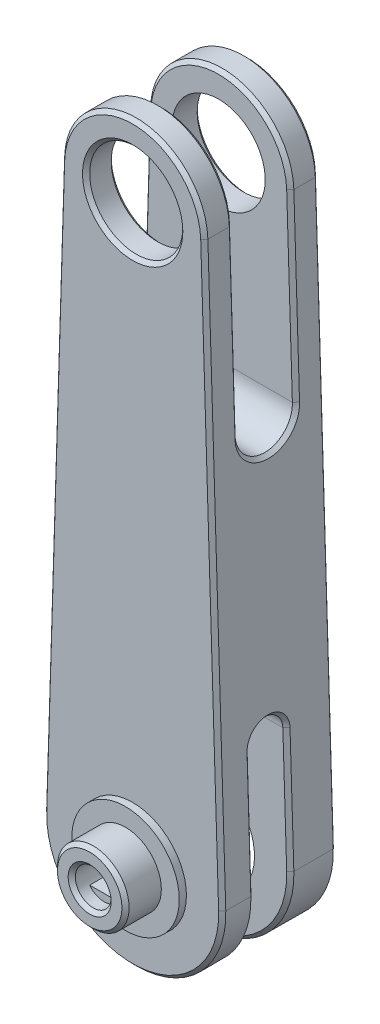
ISO-10303-21;
HEADER;
FILE_DESCRIPTION(('STEP AP214'),'2;1');
FILE_NAME('part.step','',(''),(''),'','','');
FILE_SCHEMA(('AUTOMOTIVE_DESIGN { 1 0 10303 214 1 1 1 1 }'));
ENDSEC;
DATA;
#1=APPLICATION_CONTEXT('core data for automotive mechanical design processes');
#2=APPLICATION_PROTOCOL_DEFINITION('international standard','automotive_design',2000,#1);
#3=PRODUCT_CONTEXT('',#1,'mechanical');
#4=PRODUCT('Part','Part','',(#3));
#5=PRODUCT_RELATED_PRODUCT_CATEGORY('part','',(#4));
#6=PRODUCT_DEFINITION_FORMATION('','',#4);
#7=PRODUCT_DEFINITION_CONTEXT('part definition',#1,'design');
#8=PRODUCT_DEFINITION('design','',#6,#7);
#9=PRODUCT_DEFINITION_SHAPE('','',#8);
#10=(LENGTH_UNIT() NAMED_UNIT(*) SI_UNIT(.MILLI.,.METRE.));
#11=(NAMED_UNIT(*) PLANE_ANGLE_UNIT() SI_UNIT($,.RADIAN.));
#12=(NAMED_UNIT(*) SI_UNIT($,.STERADIAN.) SOLID_ANGLE_UNIT());
#13=UNCERTAINTY_MEASURE_WITH_UNIT(LENGTH_MEASURE(1.E-05),#10,'distance_accuracy_value','');
#14=(GEOMETRIC_REPRESENTATION_CONTEXT(3) GLOBAL_UNCERTAINTY_ASSIGNED_CONTEXT((#13)) GLOBAL_UNIT_ASSIGNED_CONTEXT((#10,
#11,#12)) REPRESENTATION_CONTEXT('',''));
#15=CARTESIAN_POINT('',(0.,0.,0.));
#16=DIRECTION('',(0.,0.,1.));
#17=DIRECTION('',(1.,0.,0.));
#18=AXIS2_PLACEMENT_3D('',#15,#16,#17);
#19=CARTESIAN_POINT('',(0.,0.,8.));
#20=DIRECTION('',(0.,0.,1.));
#21=DIRECTION('',(1.,0.,0.));
#22=AXIS2_PLACEMENT_3D('',#19,#20,#21);
#23=PLANE('',#22);
#24=DIRECTION('',(-0.03125,0.999511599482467,0.));
#25=VECTOR('',#24,1.);
#26=CARTESIAN_POINT('',(9.49536019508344,80.296875,8.));
#27=LINE('',#26,#25);
#28=CARTESIAN_POINT('',(11.9941391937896,0.374999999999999,8.));
#29=VERTEX_POINT('',#28);
#30=CARTESIAN_POINT('',(9.49536019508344,80.296875,8.));
#31=VERTEX_POINT('',#30);
#32=EDGE_CURVE('E768',#29,#31,#27,.T.);
#33=ORIENTED_EDGE('',*,*,#32,.T.);
#34=CARTESIAN_POINT('',(0.,80.,8.));
#35=DIRECTION('',(0.,0.,1.));
#36=DIRECTION('',(1.,0.,0.));
#37=AXIS2_PLACEMENT_3D('',#34,#35,#36);
#38=CIRCLE('',#37,9.5);
#39=CARTESIAN_POINT('',(-9.49536019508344,80.296875,8.));
#40=VERTEX_POINT('',#39);
#41=EDGE_CURVE('E756',#31,#40,#38,.T.);
#42=ORIENTED_EDGE('',*,*,#41,.T.);
#43=DIRECTION('',(-0.03125,-0.999511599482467,0.));
#44=VECTOR('',#43,1.);
#45=CARTESIAN_POINT('',(-11.9941391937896,0.374999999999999,8.));
#46=LINE('',#45,#44);
#47=CARTESIAN_POINT('',(-11.9941391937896,0.374999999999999,8.));
#48=VERTEX_POINT('',#47);
#49=EDGE_CURVE('E760',#40,#48,#46,.T.);
#50=ORIENTED_EDGE('',*,*,#49,.T.);
#51=CARTESIAN_POINT('',(0.,0.,8.));
#52=DIRECTION('',(0.,0.,1.));
#53=DIRECTION('',(1.,0.,0.));
#54=AXIS2_PLACEMENT_3D('',#51,#52,#53);
#55=CIRCLE('',#54,12.);
#56=EDGE_CURVE('E764',#48,#29,#55,.T.);
#57=ORIENTED_EDGE('',*,*,#56,.T.);
#58=EDGE_LOOP('',(#33,#42,#50,#57));
#59=FACE_BOUND('',#58,.T.);
#60=CARTESIAN_POINT('',(0.,80.,8.));
#61=DIRECTION('',(0.,0.,1.));
#62=DIRECTION('',(1.,0.,0.));
#63=AXIS2_PLACEMENT_3D('',#60,#61,#62);
#64=CIRCLE('',#63,7.00000000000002);
#65=CARTESIAN_POINT('',(7.00000000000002,80.,8.));
#66=VERTEX_POINT('',#65);
#67=EDGE_CURVE('E770',#66,#66,#64,.F.);
#68=ORIENTED_EDGE('',*,*,#67,.T.);
#69=EDGE_LOOP('',(#68));
#70=FACE_BOUND('',#69,.T.);
#71=CARTESIAN_POINT('',(0.,0.,8.));
#72=DIRECTION('',(0.,0.,1.));
#73=DIRECTION('',(1.,0.,0.));
#74=AXIS2_PLACEMENT_3D('',#71,#72,#73);
#75=CIRCLE('',#74,7.5);
#76=CARTESIAN_POINT('',(7.5,0.,8.));
#77=VERTEX_POINT('',#76);
#78=EDGE_CURVE('E1159',#77,#77,#75,.T.);
#79=ORIENTED_EDGE('',*,*,#78,.F.);
#80=EDGE_LOOP('',(#79));
#81=FACE_BOUND('',#80,.T.);
#82=ADVANCED_FACE('F35',(#59,#70,#81),#23,.T.);
#83=CARTESIAN_POINT('',(-2.,-1.5,-8.));
#84=DIRECTION('',(0.,-1.,0.));
#85=DIRECTION('',(0.,0.,-1.));
#86=AXIS2_PLACEMENT_3D('',#83,#84,#85);
#87=PLANE('',#86);
#88=DIRECTION('',(-1.,0.,0.));
#89=VECTOR('',#88,1.);
#90=CARTESIAN_POINT('',(-2.,-1.5,12.));
#91=LINE('',#90,#89);
#92=CARTESIAN_POINT('',(2.,-1.5,12.));
#93=VERTEX_POINT('',#92);
#94=CARTESIAN_POINT('',(-2.,-1.5,12.));
#95=VERTEX_POINT('',#94);
#96=EDGE_CURVE('E262',#93,#95,#91,.T.);
#97=ORIENTED_EDGE('',*,*,#96,.F.);
#98=DIRECTION('',(0.,0.,1.));
#99=VECTOR('',#98,1.);
#100=CARTESIAN_POINT('',(2.,-1.5,-8.));
#101=LINE('',#100,#99);
#102=CARTESIAN_POINT('',(2.,-1.5,3.5));
#103=VERTEX_POINT('',#102);
#104=EDGE_CURVE('E979',#103,#93,#101,.T.);
#105=ORIENTED_EDGE('',*,*,#104,.F.);
#106=DIRECTION('',(1.,0.,0.));
#107=VECTOR('',#106,1.);
#108=CARTESIAN_POINT('',(-27.5,-1.5,3.5));
#109=LINE('',#108,#107);
#110=CARTESIAN_POINT('',(-2.,-1.5,3.5));
#111=VERTEX_POINT('',#110);
#112=EDGE_CURVE('E899',#111,#103,#109,.T.);
#113=ORIENTED_EDGE('',*,*,#112,.F.);
#114=DIRECTION('',(0.,0.,1.));
#115=VECTOR('',#114,1.);
#116=CARTESIAN_POINT('',(-2.,-1.5,-8.));
#117=LINE('',#116,#115);
#118=EDGE_CURVE('E269',#111,#95,#117,.T.);
#119=ORIENTED_EDGE('',*,*,#118,.T.);
#120=EDGE_LOOP('',(#97,#105,#113,#119));
#121=FACE_BOUND('',#120,.T.);
#122=ADVANCED_FACE('F1104',(#121),#87,.F.);
#123=CARTESIAN_POINT('',(-2.,1.5,-8.));
#124=DIRECTION('',(0.,1.,0.));
#125=DIRECTION('',(-1.,0.,0.));
#126=AXIS2_PLACEMENT_3D('',#123,#124,#125);
#127=PLANE('',#126);
#128=DIRECTION('',(1.,0.,0.));
#129=VECTOR('',#128,1.);
#130=CARTESIAN_POINT('',(-2.,1.5,12.));
#131=LINE('',#130,#129);
#132=CARTESIAN_POINT('',(-2.,1.5,12.));
#133=VERTEX_POINT('',#132);
#134=CARTESIAN_POINT('',(2.,1.5,12.));
#135=VERTEX_POINT('',#134);
#136=EDGE_CURVE('E244',#133,#135,#131,.T.);
#137=ORIENTED_EDGE('',*,*,#136,.F.);
#138=DIRECTION('',(0.,0.,1.));
#139=VECTOR('',#138,1.);
#140=CARTESIAN_POINT('',(-2.,1.5,-8.));
#141=LINE('',#140,#139);
#142=CARTESIAN_POINT('',(-2.,1.5,3.5));
#143=VERTEX_POINT('',#142);
#144=EDGE_CURVE('E261',#143,#133,#141,.T.);
#145=ORIENTED_EDGE('',*,*,#144,.F.);
#146=DIRECTION('',(-1.,0.,0.));
#147=VECTOR('',#146,1.);
#148=CARTESIAN_POINT('',(-27.5,1.49999999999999,3.5));
#149=LINE('',#148,#147);
#150=CARTESIAN_POINT('',(2.,1.5,3.5));
#151=VERTEX_POINT('',#150);
#152=EDGE_CURVE('E267',#151,#143,#149,.T.);
#153=ORIENTED_EDGE('',*,*,#152,.F.);
#154=DIRECTION('',(0.,0.,1.));
#155=VECTOR('',#154,1.);
#156=CARTESIAN_POINT('',(2.,1.5,-8.));
#157=LINE('',#156,#155);
#158=EDGE_CURVE('E258',#151,#135,#157,.T.);
#159=ORIENTED_EDGE('',*,*,#158,.T.);
#160=EDGE_LOOP('',(#137,#145,#153,#159));
#161=FACE_BOUND('',#160,.T.);
#162=ADVANCED_FACE('F265',(#161),#127,.F.);
#163=CARTESIAN_POINT('',(0.,0.,8.));
#164=DIRECTION('',(0.,0.,-1.));
#165=DIRECTION('',(-1.,0.,0.));
#166=AXIS2_PLACEMENT_3D('',#163,#164,#165);
#167=CYLINDRICAL_SURFACE('',#166,12.5);
#168=DIRECTION('',(0.,0.,-1.));
#169=VECTOR('',#168,1.);
#170=CARTESIAN_POINT('',(12.4938949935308,0.390624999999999,8.));
#171=LINE('',#170,#169);
#172=CARTESIAN_POINT('',(12.4938949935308,0.390624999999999,7.5));
#173=VERTEX_POINT('',#172);
#174=CARTESIAN_POINT('',(12.4938949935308,0.390624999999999,4.00000000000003));
#175=VERTEX_POINT('',#174);
#176=EDGE_CURVE('E880',#173,#175,#171,.T.);
#177=ORIENTED_EDGE('',*,*,#176,.F.);
#178=CARTESIAN_POINT('',(0.,0.,7.5));
#179=DIRECTION('',(0.,0.,1.));
#180=DIRECTION('',(1.,0.,0.));
#181=AXIS2_PLACEMENT_3D('',#178,#179,#180);
#182=CIRCLE('',#181,12.5);
#183=CARTESIAN_POINT('',(-12.4938949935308,0.390624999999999,7.5));
#184=VERTEX_POINT('',#183);
#185=EDGE_CURVE('E785',#173,#184,#182,.F.);
#186=ORIENTED_EDGE('',*,*,#185,.T.);
#187=DIRECTION('',(0.,0.,-1.));
#188=VECTOR('',#187,1.);
#189=CARTESIAN_POINT('',(-12.4938949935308,0.390624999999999,8.));
#190=LINE('',#189,#188);
#191=CARTESIAN_POINT('',(-12.4938949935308,0.390624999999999,4.00000000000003));
#192=VERTEX_POINT('',#191);
#193=EDGE_CURVE('E1078',#184,#192,#190,.T.);
#194=ORIENTED_EDGE('',*,*,#193,.T.);
#195=CARTESIAN_POINT('',(0.,0.,4.00000000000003));
#196=DIRECTION('',(0.,0.,1.));
#197=DIRECTION('',(1.,0.,0.));
#198=AXIS2_PLACEMENT_3D('',#195,#196,#197);
#199=CIRCLE('',#198,12.5);
#200=CARTESIAN_POINT('',(-2.24934157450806,-12.2959530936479,4.00000000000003));
#201=VERTEX_POINT('',#200);
#202=EDGE_CURVE('E783',#192,#201,#199,.T.);
#203=ORIENTED_EDGE('',*,*,#202,.T.);
#204=CARTESIAN_POINT('',(0.,0.,4.00000000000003));
#205=DIRECTION('',(0.,0.,1.));
#206=DIRECTION('',(1.,0.,0.));
#207=AXIS2_PLACEMENT_3D('',#204,#205,#206);
#208=CIRCLE('',#207,12.5);
#209=CARTESIAN_POINT('',(2.24934157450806,-12.2959530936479,4.00000000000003));
#210=VERTEX_POINT('',#209);
#211=EDGE_CURVE('E781',#201,#210,#208,.T.);
#212=ORIENTED_EDGE('',*,*,#211,.T.);
#213=CARTESIAN_POINT('',(0.,0.,4.00000000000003));
#214=DIRECTION('',(0.,0.,1.));
#215=DIRECTION('',(1.,0.,0.));
#216=AXIS2_PLACEMENT_3D('',#213,#214,#215);
#217=CIRCLE('',#216,12.5);
#218=EDGE_CURVE('E779',#210,#175,#217,.T.);
#219=ORIENTED_EDGE('',*,*,#218,.T.);
#220=EDGE_LOOP('',(#177,#186,#194,#203,#212,#219));
#221=FACE_BOUND('',#220,.T.);
#222=ADVANCED_FACE('F1139',(#221),#167,.T.);
#223=CARTESIAN_POINT('',(0.,80.,8.));
#224=DIRECTION('',(0.,0.,-1.));
#225=DIRECTION('',(-1.,0.,0.));
#226=AXIS2_PLACEMENT_3D('',#223,#224,#225);
#227=CYLINDRICAL_SURFACE('',#226,10.);
#228=DIRECTION('',(0.,0.,-1.));
#229=VECTOR('',#228,1.);
#230=CARTESIAN_POINT('',(-9.99511599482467,80.3125,8.));
#231=LINE('',#230,#229);
#232=CARTESIAN_POINT('',(-9.99511599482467,80.3125,-4.50000000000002));
#233=VERTEX_POINT('',#232);
#234=CARTESIAN_POINT('',(-9.99511599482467,80.3125,-7.49999999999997));
#235=VERTEX_POINT('',#234);
#236=EDGE_CURVE('E1072',#233,#235,#231,.T.);
#237=ORIENTED_EDGE('',*,*,#236,.F.);
#238=CARTESIAN_POINT('',(0.,80.,-4.50000000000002));
#239=DIRECTION('',(0.,0.,-1.));
#240=DIRECTION('',(-1.,0.,0.));
#241=AXIS2_PLACEMENT_3D('',#238,#239,#240);
#242=CIRCLE('',#241,10.);
#243=CARTESIAN_POINT('',(9.99511599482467,80.3125,-4.50000000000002));
#244=VERTEX_POINT('',#243);
#245=EDGE_CURVE('E836',#233,#244,#242,.T.);
#246=ORIENTED_EDGE('',*,*,#245,.T.);
#247=DIRECTION('',(0.,0.,-1.));
#248=VECTOR('',#247,1.);
#249=CARTESIAN_POINT('',(9.99511599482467,80.3125,8.));
#250=LINE('',#249,#248);
#251=CARTESIAN_POINT('',(9.99511599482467,80.3125,-7.49999999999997));
#252=VERTEX_POINT('',#251);
#253=EDGE_CURVE('E885',#244,#252,#250,.T.);
#254=ORIENTED_EDGE('',*,*,#253,.T.);
#255=CARTESIAN_POINT('',(0.,80.,-7.49999999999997));
#256=DIRECTION('',(0.,0.,1.));
#257=DIRECTION('',(1.,0.,0.));
#258=AXIS2_PLACEMENT_3D('',#255,#256,#257);
#259=CIRCLE('',#258,10.);
#260=EDGE_CURVE('E833',#252,#235,#259,.T.);
#261=ORIENTED_EDGE('',*,*,#260,.T.);
#262=EDGE_LOOP('',(#237,#246,#254,#261));
#263=FACE_BOUND('',#262,.T.);
#264=ADVANCED_FACE('F1074',(#263),#227,.T.);
#265=CARTESIAN_POINT('',(0.,80.,8.));
#266=DIRECTION('',(0.,0.,-1.));
#267=DIRECTION('',(-1.,0.,0.));
#268=AXIS2_PLACEMENT_3D('',#265,#266,#267);
#269=CYLINDRICAL_SURFACE('',#268,6.5);
#270=CARTESIAN_POINT('',(0.,80.,-7.49999999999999));
#271=DIRECTION('',(0.,0.,1.));
#272=DIRECTION('',(1.,0.,0.));
#273=AXIS2_PLACEMENT_3D('',#270,#271,#272);
#274=CIRCLE('',#273,6.5);
#275=CARTESIAN_POINT('',(6.5,80.,-7.49999999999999));
#276=VERTEX_POINT('',#275);
#277=EDGE_CURVE('E916',#276,#276,#274,.F.);
#278=ORIENTED_EDGE('',*,*,#277,.T.);
#279=EDGE_LOOP('',(#278));
#280=FACE_BOUND('',#279,.T.);
#281=CARTESIAN_POINT('',(0.,80.,-4.00000000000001));
#282=DIRECTION('',(0.,0.,-1.));
#283=DIRECTION('',(0.,1.,0.));
#284=AXIS2_PLACEMENT_3D('',#281,#282,#283);
#285=CIRCLE('',#284,6.5);
#286=CARTESIAN_POINT('',(0.,86.5,-4.00000000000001));
#287=VERTEX_POINT('',#286);
#288=EDGE_CURVE('E891',#287,#287,#285,.T.);
#289=ORIENTED_EDGE('',*,*,#288,.F.);
#290=EDGE_LOOP('',(#289));
#291=FACE_BOUND('',#290,.T.);
#292=ADVANCED_FACE('F1115',(#280,#291),#269,.F.);
#293=CARTESIAN_POINT('',(0.,0.,-8.));
#294=DIRECTION('',(0.,0.,1.));
#295=DIRECTION('',(1.,0.,0.));
#296=AXIS2_PLACEMENT_3D('',#293,#294,#295);
#297=PLANE('',#296);
#298=CARTESIAN_POINT('',(0.,80.,-8.));
#299=DIRECTION('',(0.,0.,1.));
#300=DIRECTION('',(1.,0.,0.));
#301=AXIS2_PLACEMENT_3D('',#298,#299,#300);
#302=CIRCLE('',#301,7.00000000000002);
#303=CARTESIAN_POINT('',(7.00000000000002,80.,-8.));
#304=VERTEX_POINT('',#303);
#305=EDGE_CURVE('E913',#304,#304,#302,.T.);
#306=ORIENTED_EDGE('',*,*,#305,.T.);
#307=EDGE_LOOP('',(#306));
#308=FACE_BOUND('',#307,.T.);
#309=CARTESIAN_POINT('',(0.,0.,-8.));
#310=DIRECTION('',(0.,0.,1.));
#311=DIRECTION('',(1.,0.,0.));
#312=AXIS2_PLACEMENT_3D('',#309,#310,#311);
#313=CIRCLE('',#312,9.99999999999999);
#314=CARTESIAN_POINT('',(9.99999999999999,0.,-8.));
#315=VERTEX_POINT('',#314);
#316=EDGE_CURVE('E910',#315,#315,#313,.T.);
#317=ORIENTED_EDGE('',*,*,#316,.T.);
#318=EDGE_LOOP('',(#317));
#319=FACE_BOUND('',#318,.T.);
#320=DIRECTION('',(0.03125,0.999511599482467,0.));
#321=VECTOR('',#320,1.);
#322=CARTESIAN_POINT('',(-11.9941391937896,0.374999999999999,-8.));
#323=LINE('',#322,#321);
#324=CARTESIAN_POINT('',(-11.9941391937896,0.374999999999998,-8.));
#325=VERTEX_POINT('',#324);
#326=CARTESIAN_POINT('',(-9.49536019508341,80.296875,-8.));
#327=VERTEX_POINT('',#326);
#328=EDGE_CURVE('E905',#325,#327,#323,.T.);
#329=ORIENTED_EDGE('',*,*,#328,.T.);
#330=CARTESIAN_POINT('',(0.,80.,-8.));
#331=DIRECTION('',(0.,0.,1.));
#332=DIRECTION('',(1.,0.,0.));
#333=AXIS2_PLACEMENT_3D('',#330,#331,#332);
#334=CIRCLE('',#333,9.49999999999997);
#335=CARTESIAN_POINT('',(9.49536019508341,80.296875,-8.));
#336=VERTEX_POINT('',#335);
#337=EDGE_CURVE('E907',#327,#336,#334,.F.);
#338=ORIENTED_EDGE('',*,*,#337,.T.);
#339=DIRECTION('',(0.03125,-0.999511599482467,0.));
#340=VECTOR('',#339,1.);
#341=CARTESIAN_POINT('',(11.9941391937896,0.374999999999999,-8.));
#342=LINE('',#341,#340);
#343=CARTESIAN_POINT('',(11.9941391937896,0.374999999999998,-8.));
#344=VERTEX_POINT('',#343);
#345=EDGE_CURVE('E251',#336,#344,#342,.T.);
#346=ORIENTED_EDGE('',*,*,#345,.T.);
#347=CARTESIAN_POINT('',(0.,0.,-8.));
#348=DIRECTION('',(0.,0.,1.));
#349=DIRECTION('',(1.,0.,0.));
#350=AXIS2_PLACEMENT_3D('',#347,#348,#349);
#351=CIRCLE('',#350,12.);
#352=EDGE_CURVE('E903',#344,#325,#351,.F.);
#353=ORIENTED_EDGE('',*,*,#352,.T.);
#354=EDGE_LOOP('',(#329,#338,#346,#353));
#355=FACE_BOUND('',#354,.T.);
#356=ADVANCED_FACE('F940',(#308,#319,#355),#297,.F.);
#357=CARTESIAN_POINT('',(-12.4938949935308,0.390624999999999,-2.00000000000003));
#358=VERTEX_POINT('',#357);
#359=CARTESIAN_POINT('',(-12.4938949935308,0.390624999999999,-7.49999999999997));
#360=VERTEX_POINT('',#359);
#361=EDGE_CURVE('E1080',#358,#360,#190,.T.);
#362=ORIENTED_EDGE('',*,*,#361,.T.);
#363=CARTESIAN_POINT('',(0.,0.,-7.49999999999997));
#364=DIRECTION('',(0.,0.,1.));
#365=DIRECTION('',(1.,0.,0.));
#366=AXIS2_PLACEMENT_3D('',#363,#364,#365);
#367=CIRCLE('',#366,12.5);
#368=CARTESIAN_POINT('',(12.4938949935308,0.390624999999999,-7.49999999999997));
#369=VERTEX_POINT('',#368);
#370=EDGE_CURVE('E844',#360,#369,#367,.T.);
#371=ORIENTED_EDGE('',*,*,#370,.T.);
#372=CARTESIAN_POINT('',(12.4938949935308,0.390624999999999,-2.00000000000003));
#373=VERTEX_POINT('',#372);
#374=EDGE_CURVE('E877',#373,#369,#171,.T.);
#375=ORIENTED_EDGE('',*,*,#374,.F.);
#376=CARTESIAN_POINT('',(0.,0.,-2.00000000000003));
#377=DIRECTION('',(0.,0.,-1.));
#378=DIRECTION('',(-1.,0.,0.));
#379=AXIS2_PLACEMENT_3D('',#376,#377,#378);
#380=CIRCLE('',#379,12.5);
#381=CARTESIAN_POINT('',(2.24934157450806,-12.2959530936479,-2.00000000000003));
#382=VERTEX_POINT('',#381);
#383=EDGE_CURVE('E838',#373,#382,#380,.T.);
#384=ORIENTED_EDGE('',*,*,#383,.T.);
#385=CARTESIAN_POINT('',(0.,0.,-2.00000000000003));
#386=DIRECTION('',(0.,0.,-1.));
#387=DIRECTION('',(-1.,0.,0.));
#388=AXIS2_PLACEMENT_3D('',#385,#386,#387);
#389=CIRCLE('',#388,12.5);
#390=CARTESIAN_POINT('',(-2.24934157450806,-12.2959530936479,-2.00000000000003));
#391=VERTEX_POINT('',#390);
#392=EDGE_CURVE('E840',#382,#391,#389,.T.);
#393=ORIENTED_EDGE('',*,*,#392,.T.);
#394=CARTESIAN_POINT('',(0.,0.,-2.00000000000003));
#395=DIRECTION('',(0.,0.,-1.));
#396=DIRECTION('',(-1.,0.,0.));
#397=AXIS2_PLACEMENT_3D('',#394,#395,#396);
#398=CIRCLE('',#397,12.5);
#399=EDGE_CURVE('E842',#391,#358,#398,.T.);
#400=ORIENTED_EDGE('',*,*,#399,.T.);
#401=EDGE_LOOP('',(#362,#371,#375,#384,#393,#400));
#402=FACE_BOUND('',#401,.T.);
#403=ADVANCED_FACE('F807',(#402),#167,.T.);
#404=CARTESIAN_POINT('',(9.99511599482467,80.3125,8.));
#405=DIRECTION('',(-0.999511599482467,-0.03125,0.));
#406=DIRECTION('',(0.03125,-0.999511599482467,0.));
#407=AXIS2_PLACEMENT_3D('',#404,#405,#406);
#408=PLANE('',#407);
#409=CARTESIAN_POINT('',(9.99511599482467,80.3125,7.5));
#410=VERTEX_POINT('',#409);
#411=CARTESIAN_POINT('',(9.99511599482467,80.3125,4.5));
#412=VERTEX_POINT('',#411);
#413=EDGE_CURVE('E881',#410,#412,#250,.T.);
#414=ORIENTED_EDGE('',*,*,#413,.F.);
#415=DIRECTION('',(0.03125,-0.999511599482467,0.));
#416=VECTOR('',#415,1.);
#417=CARTESIAN_POINT('',(12.4938949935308,0.390624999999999,7.5));
#418=LINE('',#417,#416);
#419=EDGE_CURVE('E829',#410,#173,#418,.T.);
#420=ORIENTED_EDGE('',*,*,#419,.T.);
#421=ORIENTED_EDGE('',*,*,#176,.T.);
#422=DIRECTION('',(-0.03125,0.999511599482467,0.));
#423=VECTOR('',#422,1.);
#424=CARTESIAN_POINT('',(9.99511599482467,80.3125,4.00000000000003));
#425=LINE('',#424,#423);
#426=CARTESIAN_POINT('',(11.9584772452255,17.515625,4.00000000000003));
#427=VERTEX_POINT('',#426);
#428=EDGE_CURVE('E787',#175,#427,#425,.T.);
#429=ORIENTED_EDGE('',*,*,#428,.T.);
#430=CARTESIAN_POINT('',(11.9584772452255,17.515625,-2.00000000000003));
#431=CARTESIAN_POINT('',(11.95233828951,17.7119756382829,-2.00001322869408));
#432=CARTESIAN_POINT('',(11.9461995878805,17.908318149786,-1.98066195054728));
#433=CARTESIAN_POINT('',(11.9341575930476,18.2934737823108,-1.90404973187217));
#434=CARTESIAN_POINT('',(11.9282547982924,18.4822709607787,-1.84677873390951));
#435=CARTESIAN_POINT('',(11.9169114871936,18.8450796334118,-1.69649846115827));
#436=CARTESIAN_POINT('',(11.9114714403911,19.0190761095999,-1.60349540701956));
#437=CARTESIAN_POINT('',(11.9012627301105,19.3455952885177,-1.38532226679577));
#438=CARTESIAN_POINT('',(11.8964944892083,19.4981044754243,-1.26016121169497));
#439=CARTESIAN_POINT('',(11.887812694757,19.7757862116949,-0.98247947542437));
#440=CARTESIAN_POINT('',(11.883899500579,19.9009472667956,-0.829970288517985));
#441=CARTESIAN_POINT('',(11.8770782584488,20.1191204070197,-0.503451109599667));
#442=CARTESIAN_POINT('',(11.8741704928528,20.212123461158,-0.329454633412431));
#443=CARTESIAN_POINT('',(11.8694719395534,20.3624037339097,0.0333540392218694));
#444=CARTESIAN_POINT('',(11.8676813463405,20.419674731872,0.222151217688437));
#445=CARTESIAN_POINT('',(11.8652860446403,20.4962869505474,0.607306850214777));
#446=CARTESIAN_POINT('',(11.8646814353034,20.515625,0.803649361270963));
#447=CARTESIAN_POINT('',(11.8646814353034,20.515625,1.19635063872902));
#448=CARTESIAN_POINT('',(11.8652860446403,20.4962869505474,1.39269314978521));
#449=CARTESIAN_POINT('',(11.8676813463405,20.419674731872,1.77784878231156));
#450=CARTESIAN_POINT('',(11.8694719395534,20.3624037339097,1.96664596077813));
#451=CARTESIAN_POINT('',(11.8741704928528,20.212123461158,2.32945463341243));
#452=CARTESIAN_POINT('',(11.8770782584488,20.1191204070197,2.50345110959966));
#453=CARTESIAN_POINT('',(11.883899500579,19.9009472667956,2.82997028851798));
#454=CARTESIAN_POINT('',(11.887812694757,19.7757862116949,2.98247947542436));
#455=CARTESIAN_POINT('',(11.8964944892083,19.4981044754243,3.26016121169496));
#456=CARTESIAN_POINT('',(11.9012627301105,19.3455952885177,3.38532226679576));
#457=CARTESIAN_POINT('',(11.9114714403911,19.0190761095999,3.60349540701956));
#458=CARTESIAN_POINT('',(11.9169114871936,18.8450796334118,3.69649846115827));
#459=CARTESIAN_POINT('',(11.9282547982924,18.4822709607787,3.8467787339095));
#460=CARTESIAN_POINT('',(11.9341575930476,18.2934737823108,3.90404973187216));
#461=CARTESIAN_POINT('',(11.9461995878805,17.908318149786,3.98066195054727));
#462=CARTESIAN_POINT('',(11.95233828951,17.711975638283,4.00001322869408));
#463=CARTESIAN_POINT('',(11.9584772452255,17.515625,4.00000000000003));
#464=B_SPLINE_CURVE_WITH_KNOTS('',3,(#430,#431,#432,#433,#434,#435,#436,#437,#438,#439,#440,
#441,#442,#443,#444,#445,#446,#447,#448,#449,#450,#451,#452,#453,#454,#455,#456,#457,#458,#459,
#460,#461,#462,#463),.UNSPECIFIED.,.F.,.F.,(4,2,2,2,2,2,2,2,2,2,2,2,2,2,2,2,4),(1.5707963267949,
1.76714586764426,1.96349540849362,2.15984494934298,2.35619449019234,2.55254403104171,
2.74889357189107,2.94524311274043,3.14159265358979,3.33794219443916,3.53429173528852,
3.73064127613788,3.92699081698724,4.1233403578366,4.31968989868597,4.51603943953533,
4.71238898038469),.UNSPECIFIED.);
#465=CARTESIAN_POINT('',(11.9584772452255,17.515625,-2.00000000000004));
#466=VERTEX_POINT('',#465);
#467=EDGE_CURVE('E790',#427,#466,#464,.F.);
#468=ORIENTED_EDGE('',*,*,#467,.T.);
#469=DIRECTION('',(0.03125,-0.999511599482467,0.));
#470=VECTOR('',#469,1.);
#471=CARTESIAN_POINT('',(9.99511599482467,80.3125,-2.00000000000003));
#472=LINE('',#471,#470);
#473=EDGE_CURVE('E701',#466,#373,#472,.T.);
#474=ORIENTED_EDGE('',*,*,#473,.T.);
#475=ORIENTED_EDGE('',*,*,#374,.T.);
#476=DIRECTION('',(-0.03125,0.999511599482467,0.));
#477=VECTOR('',#476,1.);
#478=CARTESIAN_POINT('',(9.99511599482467,80.3125,-7.49999999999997));
#479=LINE('',#478,#477);
#480=EDGE_CURVE('E824',#369,#252,#479,.T.);
#481=ORIENTED_EDGE('',*,*,#480,.T.);
#482=ORIENTED_EDGE('',*,*,#253,.F.);
#483=DIRECTION('',(0.03125,-0.999511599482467,0.));
#484=VECTOR('',#483,1.);
#485=CARTESIAN_POINT('',(9.99511599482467,80.3125,-4.50000000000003));
#486=LINE('',#485,#484);
#487=CARTESIAN_POINT('',(10.7860296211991,55.015625,-4.50000000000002));
#488=VERTEX_POINT('',#487);
#489=EDGE_CURVE('E816',#244,#488,#486,.T.);
#490=ORIENTED_EDGE('',*,*,#489,.T.);
#491=CARTESIAN_POINT('',(10.7860296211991,55.015625,4.5));
#492=CARTESIAN_POINT('',(10.7952380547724,54.7210990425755,4.50001984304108));
#493=CARTESIAN_POINT('',(10.8044461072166,54.426585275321,4.47099292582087));
#494=CARTESIAN_POINT('',(10.822509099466,53.8488518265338,4.3560745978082));
#495=CARTESIAN_POINT('',(10.8313632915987,53.5656560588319,4.27016810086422));
#496=CARTESIAN_POINT('',(10.8483782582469,53.0214430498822,4.04474769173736));
#497=CARTESIAN_POINT('',(10.8565383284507,52.7604483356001,3.9052431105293));
#498=CARTESIAN_POINT('',(10.8718513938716,52.2706695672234,3.5779834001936));
#499=CARTESIAN_POINT('',(10.8790037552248,52.0419057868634,3.3902418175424));
#500=CARTESIAN_POINT('',(10.8920264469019,51.6253831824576,2.97371921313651));
#501=CARTESIAN_POINT('',(10.8978962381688,51.4376415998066,2.74495543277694));
#502=CARTESIAN_POINT('',(10.9081281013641,51.1103818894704,2.25517666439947));
#503=CARTESIAN_POINT('',(10.9124897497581,50.970877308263,1.99418195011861));
#504=CARTESIAN_POINT('',(10.9195375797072,50.7454568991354,1.44996894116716));
#505=CARTESIAN_POINT('',(10.9222234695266,50.659550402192,1.16677317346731));
#506=CARTESIAN_POINT('',(10.9258164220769,50.5446320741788,0.589039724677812));
#507=CARTESIAN_POINT('',(10.9267233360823,50.515625,0.294525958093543));
#508=CARTESIAN_POINT('',(10.9267233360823,50.515625,-0.294525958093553));
#509=CARTESIAN_POINT('',(10.9258164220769,50.5446320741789,-0.58903972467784));
#510=CARTESIAN_POINT('',(10.9222234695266,50.659550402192,-1.16677317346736));
#511=CARTESIAN_POINT('',(10.9195375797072,50.7454568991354,-1.44996894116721));
#512=CARTESIAN_POINT('',(10.9124897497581,50.970877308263,-1.99418195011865));
#513=CARTESIAN_POINT('',(10.9081281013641,51.1103818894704,-2.2551766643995));
#514=CARTESIAN_POINT('',(10.8978962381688,51.4376415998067,-2.74495543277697));
#515=CARTESIAN_POINT('',(10.8920264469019,51.6253831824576,-2.97371921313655));
#516=CARTESIAN_POINT('',(10.8790037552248,52.0419057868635,-3.39024181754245));
#517=CARTESIAN_POINT('',(10.8718513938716,52.2706695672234,-3.57798340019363));
#518=CARTESIAN_POINT('',(10.8565383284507,52.7604483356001,-3.90524311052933));
#519=CARTESIAN_POINT('',(10.8483782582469,53.0214430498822,-4.0447476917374));
#520=CARTESIAN_POINT('',(10.8313632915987,53.565656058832,-4.27016810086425));
#521=CARTESIAN_POINT('',(10.822509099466,53.8488518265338,-4.35607459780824));
#522=CARTESIAN_POINT('',(10.8044461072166,54.426585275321,-4.4709929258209));
#523=CARTESIAN_POINT('',(10.7952380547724,54.7210990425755,-4.50001984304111));
#524=CARTESIAN_POINT('',(10.7860296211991,55.015625,-4.50000000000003));
#525=B_SPLINE_CURVE_WITH_KNOTS('',3,(#491,#492,#493,#494,#495,#496,#497,#498,#499,#500,#501,
#502,#503,#504,#505,#506,#507,#508,#509,#510,#511,#512,#513,#514,#515,#516,#517,#518,#519,#520,
#521,#522,#523,#524),.UNSPECIFIED.,.F.,.F.,(4,2,2,2,2,2,2,2,2,2,2,2,2,2,2,2,4),
(4.71238898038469,4.90873852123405,5.10508806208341,5.30143760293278,5.49778714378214,
5.6941366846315,5.89048622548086,6.08683576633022,6.28318530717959,6.47953484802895,
6.67588438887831,6.87223392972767,7.06858347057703,7.2649330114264,7.46128255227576,
7.65763209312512,7.85398163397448),.UNSPECIFIED.);
#526=CARTESIAN_POINT('',(10.7860296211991,55.015625,4.5));
#527=VERTEX_POINT('',#526);
#528=EDGE_CURVE('E823',#488,#527,#525,.F.);
#529=ORIENTED_EDGE('',*,*,#528,.T.);
#530=DIRECTION('',(-0.03125,0.999511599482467,0.));
#531=VECTOR('',#530,1.);
#532=CARTESIAN_POINT('',(9.99511599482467,80.3125,4.5));
#533=LINE('',#532,#531);
#534=EDGE_CURVE('E827',#527,#412,#533,.T.);
#535=ORIENTED_EDGE('',*,*,#534,.T.);
#536=EDGE_LOOP('',(#414,#420,#421,#429,#468,#474,#475,#481,#482,#490,#529,#535));
#537=FACE_BOUND('',#536,.T.);
#538=ADVANCED_FACE('F796',(#537),#408,.F.);
#539=CARTESIAN_POINT('',(-9.99511599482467,80.3125,7.5));
#540=VERTEX_POINT('',#539);
#541=CARTESIAN_POINT('',(-9.99511599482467,80.3125,4.5));
#542=VERTEX_POINT('',#541);
#543=EDGE_CURVE('E1053',#540,#542,#231,.T.);
#544=ORIENTED_EDGE('',*,*,#543,.F.);
#545=CARTESIAN_POINT('',(0.,80.,7.5));
#546=DIRECTION('',(0.,0.,1.));
#547=DIRECTION('',(1.,0.,0.));
#548=AXIS2_PLACEMENT_3D('',#545,#546,#547);
#549=CIRCLE('',#548,10.);
#550=EDGE_CURVE('E758',#540,#410,#549,.F.);
#551=ORIENTED_EDGE('',*,*,#550,.T.);
#552=ORIENTED_EDGE('',*,*,#413,.T.);
#553=CARTESIAN_POINT('',(0.,80.,4.5));
#554=DIRECTION('',(0.,0.,1.));
#555=DIRECTION('',(1.,0.,0.));
#556=AXIS2_PLACEMENT_3D('',#553,#554,#555);
#557=CIRCLE('',#556,10.);
#558=EDGE_CURVE('E773',#412,#542,#557,.T.);
#559=ORIENTED_EDGE('',*,*,#558,.T.);
#560=EDGE_LOOP('',(#544,#551,#552,#559));
#561=FACE_BOUND('',#560,.T.);
#562=ADVANCED_FACE('F806',(#561),#227,.T.);
#563=CARTESIAN_POINT('',(-9.99511599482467,80.3125,8.));
#564=DIRECTION('',(0.999511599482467,-0.03125,0.));
#565=DIRECTION('',(0.03125,0.999511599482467,0.));
#566=AXIS2_PLACEMENT_3D('',#563,#564,#565);
#567=PLANE('',#566);
#568=CARTESIAN_POINT('',(-10.7860296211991,55.015625,-4.50000000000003));
#569=CARTESIAN_POINT('',(-10.7952380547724,54.7210990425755,-4.5000198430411));
#570=CARTESIAN_POINT('',(-10.8044461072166,54.426585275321,-4.4709929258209));
#571=CARTESIAN_POINT('',(-10.822509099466,53.8488518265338,-4.35607459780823));
#572=CARTESIAN_POINT('',(-10.8313632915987,53.5656560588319,-4.27016810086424));
#573=CARTESIAN_POINT('',(-10.8483782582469,53.0214430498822,-4.04474769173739));
#574=CARTESIAN_POINT('',(-10.8565383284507,52.7604483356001,-3.90524311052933));
#575=CARTESIAN_POINT('',(-10.8718513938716,52.2706695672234,-3.57798340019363));
#576=CARTESIAN_POINT('',(-10.8790037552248,52.0419057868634,-3.39024181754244));
#577=CARTESIAN_POINT('',(-10.8920264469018,51.6253831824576,-2.97371921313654));
#578=CARTESIAN_POINT('',(-10.8978962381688,51.4376415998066,-2.74495543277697));
#579=CARTESIAN_POINT('',(-10.9081281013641,51.1103818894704,-2.25517666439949));
#580=CARTESIAN_POINT('',(-10.9124897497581,50.970877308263,-1.99418195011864));
#581=CARTESIAN_POINT('',(-10.9195375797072,50.7454568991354,-1.44996894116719));
#582=CARTESIAN_POINT('',(-10.9222234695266,50.659550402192,-1.16677317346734));
#583=CARTESIAN_POINT('',(-10.9258164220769,50.5446320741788,-0.589039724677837));
#584=CARTESIAN_POINT('',(-10.9267233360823,50.515625,-0.294525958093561));
#585=CARTESIAN_POINT('',(-10.9267233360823,50.515625,0.294525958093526));
#586=CARTESIAN_POINT('',(-10.9258164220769,50.5446320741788,0.589039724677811));
#587=CARTESIAN_POINT('',(-10.9222234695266,50.659550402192,1.16677317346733));
#588=CARTESIAN_POINT('',(-10.9195375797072,50.7454568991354,1.44996894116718));
#589=CARTESIAN_POINT('',(-10.9124897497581,50.970877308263,1.99418195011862));
#590=CARTESIAN_POINT('',(-10.9081281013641,51.1103818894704,2.25517666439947));
#591=CARTESIAN_POINT('',(-10.8978962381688,51.4376415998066,2.74495543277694));
#592=CARTESIAN_POINT('',(-10.8920264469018,51.6253831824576,2.97371921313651));
#593=CARTESIAN_POINT('',(-10.8790037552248,52.0419057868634,3.39024181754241));
#594=CARTESIAN_POINT('',(-10.8718513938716,52.2706695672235,3.57798340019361));
#595=CARTESIAN_POINT('',(-10.8565383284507,52.7604483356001,3.9052431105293));
#596=CARTESIAN_POINT('',(-10.8483782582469,53.0214430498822,4.04474769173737));
#597=CARTESIAN_POINT('',(-10.8313632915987,53.5656560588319,4.27016810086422));
#598=CARTESIAN_POINT('',(-10.822509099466,53.8488518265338,4.35607459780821));
#599=CARTESIAN_POINT('',(-10.8044461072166,54.426585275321,4.47099292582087));
#600=CARTESIAN_POINT('',(-10.7952380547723,54.7210990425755,4.50001984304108));
#601=CARTESIAN_POINT('',(-10.7860296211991,55.015625,4.5));
#602=B_SPLINE_CURVE_WITH_KNOTS('',3,(#568,#569,#570,#571,#572,#573,#574,#575,#576,#577,#578,
#579,#580,#581,#582,#583,#584,#585,#586,#587,#588,#589,#590,#591,#592,#593,#594,#595,#596,#597,
#598,#599,#600,#601),.UNSPECIFIED.,.F.,.F.,(4,2,2,2,2,2,2,2,2,2,2,2,2,2,2,2,4),(1.5707963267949,
1.76714586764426,1.96349540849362,2.15984494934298,2.35619449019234,2.55254403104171,
2.74889357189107,2.94524311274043,3.14159265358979,3.33794219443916,3.53429173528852,
3.73064127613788,3.92699081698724,4.1233403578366,4.31968989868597,4.51603943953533,
4.71238898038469),.UNSPECIFIED.);
#603=CARTESIAN_POINT('',(-10.7860296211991,55.015625,4.5));
#604=VERTEX_POINT('',#603);
#605=CARTESIAN_POINT('',(-10.7860296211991,55.015625,-4.50000000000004));
#606=VERTEX_POINT('',#605);
#607=EDGE_CURVE('E956',#604,#606,#602,.F.);
#608=ORIENTED_EDGE('',*,*,#607,.T.);
#609=DIRECTION('',(0.03125,0.999511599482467,0.));
#610=VECTOR('',#609,1.);
#611=CARTESIAN_POINT('',(-9.99511599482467,80.3125,-4.50000000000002));
#612=LINE('',#611,#610);
#613=EDGE_CURVE('E960',#606,#233,#612,.T.);
#614=ORIENTED_EDGE('',*,*,#613,.T.);
#615=ORIENTED_EDGE('',*,*,#236,.T.);
#616=DIRECTION('',(-0.03125,-0.999511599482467,0.));
#617=VECTOR('',#616,1.);
#618=CARTESIAN_POINT('',(-9.99511599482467,80.3125,-7.49999999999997));
#619=LINE('',#618,#617);
#620=EDGE_CURVE('E1571',#235,#360,#619,.T.);
#621=ORIENTED_EDGE('',*,*,#620,.T.);
#622=ORIENTED_EDGE('',*,*,#361,.F.);
#623=DIRECTION('',(0.03125,0.999511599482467,0.));
#624=VECTOR('',#623,1.);
#625=CARTESIAN_POINT('',(-9.99511599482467,80.3125,-2.00000000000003));
#626=LINE('',#625,#624);
#627=CARTESIAN_POINT('',(-11.9584772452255,17.515625,-2.00000000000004));
#628=VERTEX_POINT('',#627);
#629=EDGE_CURVE('E865',#358,#628,#626,.T.);
#630=ORIENTED_EDGE('',*,*,#629,.T.);
#631=CARTESIAN_POINT('',(-11.9584772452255,17.515625,4.00000000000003));
#632=CARTESIAN_POINT('',(-11.95233828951,17.7119756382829,4.00001322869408));
#633=CARTESIAN_POINT('',(-11.9461995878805,17.908318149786,3.98066195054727));
#634=CARTESIAN_POINT('',(-11.9341575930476,18.2934737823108,3.90404973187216));
#635=CARTESIAN_POINT('',(-11.9282547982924,18.4822709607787,3.8467787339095));
#636=CARTESIAN_POINT('',(-11.9169114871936,18.8450796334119,3.69649846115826));
#637=CARTESIAN_POINT('',(-11.9114714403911,19.0190761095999,3.60349540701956));
#638=CARTESIAN_POINT('',(-11.9012627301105,19.3455952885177,3.38532226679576));
#639=CARTESIAN_POINT('',(-11.8964944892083,19.4981044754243,3.26016121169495));
#640=CARTESIAN_POINT('',(-11.887812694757,19.7757862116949,2.98247947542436));
#641=CARTESIAN_POINT('',(-11.883899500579,19.9009472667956,2.82997028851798));
#642=CARTESIAN_POINT('',(-11.8770782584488,20.1191204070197,2.50345110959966));
#643=CARTESIAN_POINT('',(-11.8741704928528,20.212123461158,2.32945463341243));
#644=CARTESIAN_POINT('',(-11.8694719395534,20.3624037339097,1.96664596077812));
#645=CARTESIAN_POINT('',(-11.8676813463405,20.419674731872,1.77784878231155));
#646=CARTESIAN_POINT('',(-11.8652860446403,20.4962869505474,1.39269314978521));
#647=CARTESIAN_POINT('',(-11.8646814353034,20.515625,1.19635063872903));
#648=CARTESIAN_POINT('',(-11.8646814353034,20.515625,0.803649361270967));
#649=CARTESIAN_POINT('',(-11.8652860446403,20.4962869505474,0.607306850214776));
#650=CARTESIAN_POINT('',(-11.8676813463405,20.419674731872,0.222151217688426));
#651=CARTESIAN_POINT('',(-11.8694719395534,20.3624037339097,0.0333540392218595));
#652=CARTESIAN_POINT('',(-11.8741704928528,20.212123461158,-0.329454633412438));
#653=CARTESIAN_POINT('',(-11.8770782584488,20.1191204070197,-0.50345110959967));
#654=CARTESIAN_POINT('',(-11.883899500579,19.9009472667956,-0.829970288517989));
#655=CARTESIAN_POINT('',(-11.887812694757,19.7757862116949,-0.982479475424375));
#656=CARTESIAN_POINT('',(-11.8964944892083,19.4981044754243,-1.26016121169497));
#657=CARTESIAN_POINT('',(-11.9012627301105,19.3455952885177,-1.38532226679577));
#658=CARTESIAN_POINT('',(-11.9114714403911,19.0190761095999,-1.60349540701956));
#659=CARTESIAN_POINT('',(-11.9169114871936,18.8450796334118,-1.69649846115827));
#660=CARTESIAN_POINT('',(-11.9282547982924,18.4822709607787,-1.84677873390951));
#661=CARTESIAN_POINT('',(-11.9341575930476,18.2934737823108,-1.90404973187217));
#662=CARTESIAN_POINT('',(-11.9461995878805,17.908318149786,-1.98066195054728));
#663=CARTESIAN_POINT('',(-11.95233828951,17.7119756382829,-2.00001322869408));
#664=CARTESIAN_POINT('',(-11.9584772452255,17.515625,-2.00000000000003));
#665=B_SPLINE_CURVE_WITH_KNOTS('',3,(#631,#632,#633,#634,#635,#636,#637,#638,#639,#640,#641,
#642,#643,#644,#645,#646,#647,#648,#649,#650,#651,#652,#653,#654,#655,#656,#657,#658,#659,#660,
#661,#662,#663,#664),.UNSPECIFIED.,.F.,.F.,(4,2,2,2,2,2,2,2,2,2,2,2,2,2,2,2,4),
(4.71238898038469,4.90873852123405,5.10508806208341,5.30143760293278,5.49778714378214,
5.6941366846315,5.89048622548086,6.08683576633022,6.28318530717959,6.47953484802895,
6.67588438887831,6.87223392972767,7.06858347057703,7.2649330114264,7.46128255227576,
7.65763209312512,7.85398163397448),.UNSPECIFIED.);
#666=CARTESIAN_POINT('',(-11.9584772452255,17.515625,4.00000000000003));
#667=VERTEX_POINT('',#666);
#668=EDGE_CURVE('E925',#628,#667,#665,.F.);
#669=ORIENTED_EDGE('',*,*,#668,.T.);
#670=DIRECTION('',(-0.03125,-0.999511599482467,0.));
#671=VECTOR('',#670,1.);
#672=CARTESIAN_POINT('',(-9.99511599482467,80.3125,4.00000000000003));
#673=LINE('',#672,#671);
#674=EDGE_CURVE('E922',#667,#192,#673,.T.);
#675=ORIENTED_EDGE('',*,*,#674,.T.);
#676=ORIENTED_EDGE('',*,*,#193,.F.);
#677=DIRECTION('',(0.03125,0.999511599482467,0.));
#678=VECTOR('',#677,1.);
#679=CARTESIAN_POINT('',(-9.99511599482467,80.3125,7.5));
#680=LINE('',#679,#678);
#681=EDGE_CURVE('E957',#184,#540,#680,.T.);
#682=ORIENTED_EDGE('',*,*,#681,.T.);
#683=ORIENTED_EDGE('',*,*,#543,.T.);
#684=DIRECTION('',(-0.03125,-0.999511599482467,0.));
#685=VECTOR('',#684,1.);
#686=CARTESIAN_POINT('',(-9.99511599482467,80.3125,4.5));
#687=LINE('',#686,#685);
#688=EDGE_CURVE('E949',#542,#604,#687,.T.);
#689=ORIENTED_EDGE('',*,*,#688,.T.);
#690=EDGE_LOOP('',(#608,#614,#615,#621,#622,#630,#669,#675,#676,#682,#683,#689));
#691=FACE_BOUND('',#690,.T.);
#692=ADVANCED_FACE('F930',(#691),#567,.F.);
#693=CARTESIAN_POINT('',(0.,80.,7.49999999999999));
#694=DIRECTION('',(0.,0.,1.));
#695=DIRECTION('',(1.,0.,0.));
#696=AXIS2_PLACEMENT_3D('',#693,#694,#695);
#697=CIRCLE('',#696,6.5);
#698=CARTESIAN_POINT('',(6.5,80.,7.49999999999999));
#699=VERTEX_POINT('',#698);
#700=EDGE_CURVE('E1041',#699,#699,#697,.T.);
#701=ORIENTED_EDGE('',*,*,#700,.T.);
#702=EDGE_LOOP('',(#701));
#703=FACE_BOUND('',#702,.T.);
#704=CARTESIAN_POINT('',(0.,80.,4.49999999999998));
#705=DIRECTION('',(0.,0.,1.));
#706=DIRECTION('',(1.,0.,0.));
#707=AXIS2_PLACEMENT_3D('',#704,#705,#706);
#708=CIRCLE('',#707,6.5);
#709=CARTESIAN_POINT('',(6.5,80.,4.49999999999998));
#710=VERTEX_POINT('',#709);
#711=EDGE_CURVE('E1038',#710,#710,#708,.F.);
#712=ORIENTED_EDGE('',*,*,#711,.T.);
#713=EDGE_LOOP('',(#712));
#714=FACE_BOUND('',#713,.T.);
#715=ADVANCED_FACE('F939',(#703,#714),#269,.F.);
#716=CARTESIAN_POINT('',(0.,0.,14.));
#717=DIRECTION('',(0.,0.,1.));
#718=DIRECTION('',(1.,0.,0.));
#719=AXIS2_PLACEMENT_3D('',#716,#717,#718);
#720=PLANE('',#719);
#721=CARTESIAN_POINT('',(0.,0.,14.));
#722=DIRECTION('',(0.,0.,1.));
#723=DIRECTION('',(1.,0.,0.));
#724=AXIS2_PLACEMENT_3D('',#721,#722,#723);
#725=CIRCLE('',#724,4.50000000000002);
#726=CARTESIAN_POINT('',(4.50000000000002,0.,14.));
#727=VERTEX_POINT('',#726);
#728=EDGE_CURVE('E1029',#727,#727,#725,.T.);
#729=ORIENTED_EDGE('',*,*,#728,.T.);
#730=EDGE_LOOP('',(#729));
#731=FACE_BOUND('',#730,.T.);
#732=CARTESIAN_POINT('',(0.,0.,14.));
#733=DIRECTION('',(0.,0.,1.));
#734=DIRECTION('',(1.,0.,0.));
#735=AXIS2_PLACEMENT_3D('',#732,#733,#734);
#736=CIRCLE('',#735,3.);
#737=CARTESIAN_POINT('',(3.,0.,14.));
#738=VERTEX_POINT('',#737);
#739=EDGE_CURVE('E1026',#738,#738,#736,.F.);
#740=ORIENTED_EDGE('',*,*,#739,.T.);
#741=EDGE_LOOP('',(#740));
#742=FACE_BOUND('',#741,.T.);
#743=ADVANCED_FACE('F1113',(#731,#742),#720,.T.);
#744=CARTESIAN_POINT('',(0.,0.,14.));
#745=DIRECTION('',(0.,0.,-1.));
#746=DIRECTION('',(-1.,0.,0.));
#747=AXIS2_PLACEMENT_3D('',#744,#745,#746);
#748=CYLINDRICAL_SURFACE('',#747,5.);
#749=CARTESIAN_POINT('',(0.,0.,9.));
#750=DIRECTION('',(0.,0.,1.));
#751=DIRECTION('',(1.,0.,0.));
#752=AXIS2_PLACEMENT_3D('',#749,#750,#751);
#753=CIRCLE('',#752,5.);
#754=CARTESIAN_POINT('',(5.,0.,9.));
#755=VERTEX_POINT('',#754);
#756=EDGE_CURVE('E1158',#755,#755,#753,.T.);
#757=ORIENTED_EDGE('',*,*,#756,.T.);
#758=EDGE_LOOP('',(#757));
#759=FACE_BOUND('',#758,.T.);
#760=CARTESIAN_POINT('',(0.,0.,13.5));
#761=DIRECTION('',(0.,0.,1.));
#762=DIRECTION('',(1.,0.,0.));
#763=AXIS2_PLACEMENT_3D('',#760,#761,#762);
#764=CIRCLE('',#763,5.);
#765=CARTESIAN_POINT('',(5.,0.,13.5));
#766=VERTEX_POINT('',#765);
#767=EDGE_CURVE('E1032',#766,#766,#764,.F.);
#768=ORIENTED_EDGE('',*,*,#767,.T.);
#769=EDGE_LOOP('',(#768));
#770=FACE_BOUND('',#769,.T.);
#771=ADVANCED_FACE('F1100',(#759,#770),#748,.T.);
#772=CARTESIAN_POINT('',(0.,0.,-3.));
#773=DIRECTION('',(0.,0.,-1.));
#774=DIRECTION('',(-1.,0.,0.));
#775=AXIS2_PLACEMENT_3D('',#772,#773,#774);
#776=CYLINDRICAL_SURFACE('',#775,9.5);
#777=CARTESIAN_POINT('',(0.,0.,-7.5));
#778=DIRECTION('',(0.,0.,1.));
#779=DIRECTION('',(1.,0.,0.));
#780=AXIS2_PLACEMENT_3D('',#777,#778,#779);
#781=CIRCLE('',#780,9.5);
#782=CARTESIAN_POINT('',(9.5,0.,-7.5));
#783=VERTEX_POINT('',#782);
#784=EDGE_CURVE('E919',#783,#783,#781,.F.);
#785=ORIENTED_EDGE('',*,*,#784,.T.);
#786=EDGE_LOOP('',(#785));
#787=FACE_BOUND('',#786,.T.);
#788=CARTESIAN_POINT('',(0.,0.,-3.));
#789=DIRECTION('',(0.,0.,-1.));
#790=DIRECTION('',(-1.,0.,0.));
#791=AXIS2_PLACEMENT_3D('',#788,#789,#790);
#792=CIRCLE('',#791,9.5);
#793=CARTESIAN_POINT('',(-9.5,0.,-3.));
#794=VERTEX_POINT('',#793);
#795=EDGE_CURVE('E1082',#794,#794,#792,.T.);
#796=ORIENTED_EDGE('',*,*,#795,.F.);
#797=EDGE_LOOP('',(#796));
#798=FACE_BOUND('',#797,.T.);
#799=ADVANCED_FACE('F1093',(#787,#798),#776,.F.);
#800=CARTESIAN_POINT('',(0.,0.,-3.));
#801=DIRECTION('',(0.,0.,-1.));
#802=DIRECTION('',(-1.,0.,0.));
#803=AXIS2_PLACEMENT_3D('',#800,#801,#802);
#804=PLANE('',#803);
#805=CARTESIAN_POINT('',(0.,0.,-3.));
#806=DIRECTION('',(0.,0.,-1.));
#807=DIRECTION('',(-1.,0.,0.));
#808=AXIS2_PLACEMENT_3D('',#805,#806,#807);
#809=CIRCLE('',#808,7.5);
#810=CARTESIAN_POINT('',(-7.5,0.,-3.));
#811=VERTEX_POINT('',#810);
#812=EDGE_CURVE('E894',#811,#811,#809,.T.);
#813=ORIENTED_EDGE('',*,*,#812,.F.);
#814=EDGE_LOOP('',(#813));
#815=FACE_BOUND('',#814,.T.);
#816=ORIENTED_EDGE('',*,*,#795,.T.);
#817=EDGE_LOOP('',(#816));
#818=FACE_BOUND('',#817,.T.);
#819=ADVANCED_FACE('F1091',(#815,#818),#804,.T.);
#820=CARTESIAN_POINT('',(0.,0.,-1.));
#821=DIRECTION('',(0.,0.,-1.));
#822=DIRECTION('',(-1.,0.,0.));
#823=AXIS2_PLACEMENT_3D('',#820,#821,#822);
#824=CYLINDRICAL_SURFACE('',#823,7.5);
#825=CARTESIAN_POINT('',(0.,0.,-1.5));
#826=DIRECTION('',(0.,0.,-1.));
#827=DIRECTION('',(0.,1.,0.));
#828=AXIS2_PLACEMENT_3D('',#825,#826,#827);
#829=CIRCLE('',#828,7.5);
#830=CARTESIAN_POINT('',(0.,7.5,-1.5));
#831=VERTEX_POINT('',#830);
#832=EDGE_CURVE('E283',#831,#831,#829,.F.);
#833=ORIENTED_EDGE('',*,*,#832,.T.);
#834=EDGE_LOOP('',(#833));
#835=FACE_BOUND('',#834,.T.);
#836=ORIENTED_EDGE('',*,*,#812,.T.);
#837=EDGE_LOOP('',(#836));
#838=FACE_BOUND('',#837,.T.);
#839=ADVANCED_FACE('F1089',(#835,#838),#824,.F.);
#840=CARTESIAN_POINT('',(-27.5,-12.2959530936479,3.5));
#841=DIRECTION('',(0.,0.,1.));
#842=DIRECTION('',(0.,-1.,0.));
#843=AXIS2_PLACEMENT_3D('',#840,#841,#842);
#844=PLANE('',#843);
#845=ORIENTED_EDGE('',*,*,#112,.T.);
#846=CARTESIAN_POINT('',(0.,0.,3.5));
#847=DIRECTION('',(0.,0.,1.));
#848=DIRECTION('',(0.,-1.,0.));
#849=AXIS2_PLACEMENT_3D('',#846,#847,#848);
#850=CIRCLE('',#849,2.5);
#851=EDGE_CURVE('E252',#103,#151,#850,.T.);
#852=ORIENTED_EDGE('',*,*,#851,.T.);
#853=ORIENTED_EDGE('',*,*,#152,.T.);
#854=CARTESIAN_POINT('',(0.,0.,3.5));
#855=DIRECTION('',(0.,0.,1.));
#856=DIRECTION('',(0.,-1.,0.));
#857=AXIS2_PLACEMENT_3D('',#854,#855,#856);
#858=CIRCLE('',#857,2.5);
#859=EDGE_CURVE('E896',#143,#111,#858,.T.);
#860=ORIENTED_EDGE('',*,*,#859,.T.);
#861=EDGE_LOOP('',(#845,#852,#853,#860));
#862=FACE_BOUND('',#861,.T.);
#863=CARTESIAN_POINT('',(0.,0.,3.5));
#864=DIRECTION('',(0.,0.,1.));
#865=DIRECTION('',(0.,-1.,0.));
#866=AXIS2_PLACEMENT_3D('',#863,#864,#865);
#867=CIRCLE('',#866,12.);
#868=CARTESIAN_POINT('',(-2.15936791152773,-11.804114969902,3.5));
#869=VERTEX_POINT('',#868);
#870=CARTESIAN_POINT('',(-11.9941391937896,0.374999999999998,3.5));
#871=VERTEX_POINT('',#870);
#872=EDGE_CURVE('E46',#869,#871,#867,.F.);
#873=ORIENTED_EDGE('',*,*,#872,.T.);
#874=DIRECTION('',(0.03125,0.999511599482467,0.));
#875=VECTOR('',#874,1.);
#876=CARTESIAN_POINT('',(-12.4050555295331,-12.7679006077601,3.5));
#877=LINE('',#876,#875);
#878=CARTESIAN_POINT('',(-11.4587214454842,17.5,3.5));
#879=VERTEX_POINT('',#878);
#880=EDGE_CURVE('E11',#871,#879,#877,.T.);
#881=ORIENTED_EDGE('',*,*,#880,.T.);
#882=DIRECTION('',(1.,0.,0.));
#883=VECTOR('',#882,1.);
#884=CARTESIAN_POINT('',(-27.5,17.5,3.5));
#885=LINE('',#884,#883);
#886=CARTESIAN_POINT('',(11.4587214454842,17.5,3.5));
#887=VERTEX_POINT('',#886);
#888=EDGE_CURVE('E279',#879,#887,#885,.T.);
#889=ORIENTED_EDGE('',*,*,#888,.T.);
#890=DIRECTION('',(0.03125,-0.999511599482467,0.));
#891=VECTOR('',#890,1.);
#892=CARTESIAN_POINT('',(12.3513445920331,-11.0499900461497,3.5));
#893=LINE('',#892,#891);
#894=CARTESIAN_POINT('',(11.9941391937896,0.374999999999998,3.5));
#895=VERTEX_POINT('',#894);
#896=EDGE_CURVE('E316',#887,#895,#893,.T.);
#897=ORIENTED_EDGE('',*,*,#896,.T.);
#898=CARTESIAN_POINT('',(0.,0.,3.5));
#899=DIRECTION('',(0.,0.,1.));
#900=DIRECTION('',(0.,-1.,0.));
#901=AXIS2_PLACEMENT_3D('',#898,#899,#900);
#902=CIRCLE('',#901,12.);
#903=CARTESIAN_POINT('',(2.15936791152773,-11.804114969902,3.5));
#904=VERTEX_POINT('',#903);
#905=EDGE_CURVE('E323',#895,#904,#902,.F.);
#906=ORIENTED_EDGE('',*,*,#905,.T.);
#907=CARTESIAN_POINT('',(0.,0.,3.5));
#908=DIRECTION('',(0.,0.,1.));
#909=DIRECTION('',(0.,-1.,0.));
#910=AXIS2_PLACEMENT_3D('',#907,#908,#909);
#911=CIRCLE('',#910,12.);
#912=EDGE_CURVE('E57',#904,#869,#911,.F.);
#913=ORIENTED_EDGE('',*,*,#912,.T.);
#914=EDGE_LOOP('',(#873,#881,#889,#897,#906,#913));
#915=FACE_BOUND('',#914,.T.);
#916=ADVANCED_FACE('F309',(#862,#915),#844,.F.);
#917=CARTESIAN_POINT('',(-27.5,17.5,0.999999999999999));
#918=DIRECTION('',(1.,0.,0.));
#919=DIRECTION('',(0.,0.,-1.));
#920=AXIS2_PLACEMENT_3D('',#917,#918,#919);
#921=CYLINDRICAL_SURFACE('',#920,2.5);
#922=ORIENTED_EDGE('',*,*,#888,.F.);
#923=CARTESIAN_POINT('',(-11.4587214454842,17.5,-1.5));
#924=CARTESIAN_POINT('',(-11.4525824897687,17.6636255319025,-1.50001102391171));
#925=CARTESIAN_POINT('',(-11.4464437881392,17.8272442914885,-1.48388495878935));
#926=CARTESIAN_POINT('',(-11.4344017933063,18.1482073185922,-1.42004144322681));
#927=CARTESIAN_POINT('',(-11.4284989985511,18.305538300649,-1.37231561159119));
#928=CARTESIAN_POINT('',(-11.4171556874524,18.6078788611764,-1.24708205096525));
#929=CARTESIAN_POINT('',(-11.4117156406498,18.7528759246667,-1.16957950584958));
#930=CARTESIAN_POINT('',(-11.4015069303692,19.0249752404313,-0.987768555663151));
#931=CARTESIAN_POINT('',(-11.3967386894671,19.1520662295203,-0.883467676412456));
#932=CARTESIAN_POINT('',(-11.3880568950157,19.3834676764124,-0.652066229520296));
#933=CARTESIAN_POINT('',(-11.3841437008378,19.4877685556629,-0.524975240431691));
#934=CARTESIAN_POINT('',(-11.3773224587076,19.6695795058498,-0.252875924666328));
#935=CARTESIAN_POINT('',(-11.3744146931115,19.747082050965,-0.107878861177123));
#936=CARTESIAN_POINT('',(-11.3697161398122,19.8723156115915,0.194461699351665));
#937=CARTESIAN_POINT('',(-11.3679255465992,19.9200414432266,0.351792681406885));
#938=CARTESIAN_POINT('',(-11.365530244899,19.9838849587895,0.672755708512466));
#939=CARTESIAN_POINT('',(-11.3649256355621,20.,0.836374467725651));
#940=CARTESIAN_POINT('',(-11.3649256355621,20.,1.16362553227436));
#941=CARTESIAN_POINT('',(-11.365530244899,19.9838849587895,1.32724429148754));
#942=CARTESIAN_POINT('',(-11.3679255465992,19.9200414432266,1.6482073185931));
#943=CARTESIAN_POINT('',(-11.3697161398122,19.8723156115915,1.80553830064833));
#944=CARTESIAN_POINT('',(-11.3744146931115,19.747082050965,2.10787886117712));
#945=CARTESIAN_POINT('',(-11.3773224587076,19.6695795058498,2.25287592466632));
#946=CARTESIAN_POINT('',(-11.3841437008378,19.4877685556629,2.52497524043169));
#947=CARTESIAN_POINT('',(-11.3880568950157,19.3834676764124,2.65206622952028));
#948=CARTESIAN_POINT('',(-11.3967386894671,19.1520662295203,2.88346767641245));
#949=CARTESIAN_POINT('',(-11.4015069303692,19.0249752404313,2.98776855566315));
#950=CARTESIAN_POINT('',(-11.4117156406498,18.7528759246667,3.16957950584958));
#951=CARTESIAN_POINT('',(-11.4171556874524,18.6078788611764,3.24708205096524));
#952=CARTESIAN_POINT('',(-11.4284989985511,18.305538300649,3.37231561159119));
#953=CARTESIAN_POINT('',(-11.4344017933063,18.1482073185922,3.42004144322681));
#954=CARTESIAN_POINT('',(-11.4464437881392,17.8272442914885,3.48388495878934));
#955=CARTESIAN_POINT('',(-11.4525824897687,17.6636255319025,3.50001102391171));
#956=CARTESIAN_POINT('',(-11.4587214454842,17.5,3.5));
#957=B_SPLINE_CURVE_WITH_KNOTS('',3,(#923,#924,#925,#926,#927,#928,#929,#930,#931,#932,#933,
#934,#935,#936,#937,#938,#939,#940,#941,#942,#943,#944,#945,#946,#947,#948,#949,#950,#951,#952,
#953,#954,#955,#956),.UNSPECIFIED.,.F.,.F.,(4,2,2,2,2,2,2,2,2,2,2,2,2,2,2,2,4),
(4.71238898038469,4.90873852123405,5.10508806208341,5.30143760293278,5.49778714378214,
5.6941366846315,5.89048622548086,6.08683576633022,6.28318530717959,6.47953484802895,
6.67588438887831,6.87223392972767,7.06858347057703,7.2649330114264,7.46128255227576,
7.65763209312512,7.85398163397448),.UNSPECIFIED.);
#958=CARTESIAN_POINT('',(-11.4587214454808,17.5,-1.5));
#959=VERTEX_POINT('',#958);
#960=EDGE_CURVE('E324',#879,#959,#957,.F.);
#961=ORIENTED_EDGE('',*,*,#960,.T.);
#962=DIRECTION('',(1.,0.,0.));
#963=VECTOR('',#962,1.);
#964=CARTESIAN_POINT('',(-27.5,17.5,-1.5));
#965=LINE('',#964,#963);
#966=CARTESIAN_POINT('',(11.4587214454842,17.5,-1.5));
#967=VERTEX_POINT('',#966);
#968=EDGE_CURVE('E284',#959,#967,#965,.T.);
#969=ORIENTED_EDGE('',*,*,#968,.T.);
#970=CARTESIAN_POINT('',(11.4587214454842,17.5,3.5));
#971=CARTESIAN_POINT('',(11.4525824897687,17.6636255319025,3.50001102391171));
#972=CARTESIAN_POINT('',(11.4464437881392,17.8272442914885,3.48388495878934));
#973=CARTESIAN_POINT('',(11.4344017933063,18.1482073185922,3.42004144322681));
#974=CARTESIAN_POINT('',(11.4284989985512,18.305538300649,3.37231561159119));
#975=CARTESIAN_POINT('',(11.4171556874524,18.6078788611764,3.24708205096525));
#976=CARTESIAN_POINT('',(11.4117156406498,18.7528759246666,3.16957950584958));
#977=CARTESIAN_POINT('',(11.4015069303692,19.0249752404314,2.98776855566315));
#978=CARTESIAN_POINT('',(11.3967386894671,19.1520662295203,2.88346767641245));
#979=CARTESIAN_POINT('',(11.3880568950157,19.3834676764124,2.65206622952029));
#980=CARTESIAN_POINT('',(11.3841437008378,19.4877685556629,2.52497524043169));
#981=CARTESIAN_POINT('',(11.3773224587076,19.6695795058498,2.25287592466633));
#982=CARTESIAN_POINT('',(11.3744146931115,19.747082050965,2.10787886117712));
#983=CARTESIAN_POINT('',(11.3697161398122,19.8723156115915,1.80553830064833));
#984=CARTESIAN_POINT('',(11.3679255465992,19.9200414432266,1.64820731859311));
#985=CARTESIAN_POINT('',(11.365530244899,19.9838849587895,1.32724429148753));
#986=CARTESIAN_POINT('',(11.3649256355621,20.,1.16362553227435));
#987=CARTESIAN_POINT('',(11.3649256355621,20.,0.836374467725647));
#988=CARTESIAN_POINT('',(11.365530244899,19.9838849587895,0.672755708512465));
#989=CARTESIAN_POINT('',(11.3679255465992,19.9200414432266,0.351792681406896));
#990=CARTESIAN_POINT('',(11.3697161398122,19.8723156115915,0.194461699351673));
#991=CARTESIAN_POINT('',(11.3744146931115,19.747082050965,-0.107878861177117));
#992=CARTESIAN_POINT('',(11.3773224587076,19.6695795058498,-0.252875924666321));
#993=CARTESIAN_POINT('',(11.3841437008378,19.4877685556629,-0.524975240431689));
#994=CARTESIAN_POINT('',(11.3880568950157,19.3834676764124,-0.652066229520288));
#995=CARTESIAN_POINT('',(11.3967386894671,19.1520662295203,-0.883467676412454));
#996=CARTESIAN_POINT('',(11.4015069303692,19.0249752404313,-0.987768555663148));
#997=CARTESIAN_POINT('',(11.4117156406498,18.7528759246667,-1.16957950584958));
#998=CARTESIAN_POINT('',(11.4171556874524,18.6078788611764,-1.24708205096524));
#999=CARTESIAN_POINT('',(11.4284989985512,18.305538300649,-1.37231561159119));
#1000=CARTESIAN_POINT('',(11.4344017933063,18.1482073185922,-1.42004144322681));
#1001=CARTESIAN_POINT('',(11.4464437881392,17.8272442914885,-1.48388495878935));
#1002=CARTESIAN_POINT('',(11.4525824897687,17.6636255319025,-1.50001102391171));
#1003=CARTESIAN_POINT('',(11.4587214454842,17.5,-1.5));
#1004=B_SPLINE_CURVE_WITH_KNOTS('',3,(#970,#971,#972,#973,#974,#975,#976,#977,#978,#979,#980,
#981,#982,#983,#984,#985,#986,#987,#988,#989,#990,#991,#992,#993,#994,#995,#996,#997,#998,#999,
#1000,#1001,#1002,#1003),.UNSPECIFIED.,.F.,.F.,(4,2,2,2,2,2,2,2,2,2,2,2,2,2,2,2,4),
(1.5707963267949,1.76714586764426,1.96349540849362,2.15984494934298,2.35619449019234,
2.55254403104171,2.74889357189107,2.94524311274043,3.14159265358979,3.33794219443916,
3.53429173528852,3.73064127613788,3.92699081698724,4.1233403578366,4.31968989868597,
4.51603943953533,4.71238898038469),.UNSPECIFIED.);
#1005=EDGE_CURVE('E292',#967,#887,#1004,.F.);
#1006=ORIENTED_EDGE('',*,*,#1005,.T.);
#1007=EDGE_LOOP('',(#922,#961,#969,#1006));
#1008=FACE_BOUND('',#1007,.T.);
#1009=ADVANCED_FACE('F298',(#1008),#921,.F.);
#1010=CARTESIAN_POINT('',(-27.5,-12.2959530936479,-1.5));
#1011=DIRECTION('',(0.,0.,-1.));
#1012=DIRECTION('',(0.,1.,0.));
#1013=AXIS2_PLACEMENT_3D('',#1010,#1011,#1012);
#1014=PLANE('',#1013);
#1015=ORIENTED_EDGE('',*,*,#832,.F.);
#1016=EDGE_LOOP('',(#1015));
#1017=FACE_BOUND('',#1016,.T.);
#1018=ORIENTED_EDGE('',*,*,#968,.F.);
#1019=DIRECTION('',(-0.03125,-0.999511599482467,0.));
#1020=VECTOR('',#1019,1.);
#1021=CARTESIAN_POINT('',(-12.4050555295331,-12.7679006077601,-1.5));
#1022=LINE('',#1021,#1020);
#1023=CARTESIAN_POINT('',(-11.9941391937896,0.374999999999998,-1.5));
#1024=VERTEX_POINT('',#1023);
#1025=EDGE_CURVE('E696',#959,#1024,#1022,.T.);
#1026=ORIENTED_EDGE('',*,*,#1025,.T.);
#1027=CARTESIAN_POINT('',(0.,0.,-1.5));
#1028=DIRECTION('',(0.,0.,-1.));
#1029=DIRECTION('',(0.,1.,0.));
#1030=AXIS2_PLACEMENT_3D('',#1027,#1028,#1029);
#1031=CIRCLE('',#1030,12.);
#1032=CARTESIAN_POINT('',(-2.15936791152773,-11.804114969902,-1.5));
#1033=VERTEX_POINT('',#1032);
#1034=EDGE_CURVE('E855',#1024,#1033,#1031,.F.);
#1035=ORIENTED_EDGE('',*,*,#1034,.T.);
#1036=CARTESIAN_POINT('',(0.,0.,-1.5));
#1037=DIRECTION('',(0.,0.,-1.));
#1038=DIRECTION('',(0.,1.,0.));
#1039=AXIS2_PLACEMENT_3D('',#1036,#1037,#1038);
#1040=CIRCLE('',#1039,12.);
#1041=CARTESIAN_POINT('',(2.15936791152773,-11.804114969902,-1.5));
#1042=VERTEX_POINT('',#1041);
#1043=EDGE_CURVE('E853',#1033,#1042,#1040,.F.);
#1044=ORIENTED_EDGE('',*,*,#1043,.T.);
#1045=CARTESIAN_POINT('',(0.,0.,-1.5));
#1046=DIRECTION('',(0.,0.,-1.));
#1047=DIRECTION('',(0.,1.,0.));
#1048=AXIS2_PLACEMENT_3D('',#1045,#1046,#1047);
#1049=CIRCLE('',#1048,12.);
#1050=CARTESIAN_POINT('',(11.9941391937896,0.374999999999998,-1.5));
#1051=VERTEX_POINT('',#1050);
#1052=EDGE_CURVE('E849',#1042,#1051,#1049,.F.);
#1053=ORIENTED_EDGE('',*,*,#1052,.T.);
#1054=DIRECTION('',(-0.03125,0.999511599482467,0.));
#1055=VECTOR('',#1054,1.);
#1056=CARTESIAN_POINT('',(12.3513445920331,-11.0499900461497,-1.5));
#1057=LINE('',#1056,#1055);
#1058=EDGE_CURVE('E699',#1051,#967,#1057,.T.);
#1059=ORIENTED_EDGE('',*,*,#1058,.T.);
#1060=EDGE_LOOP('',(#1018,#1026,#1035,#1044,#1053,#1059));
#1061=FACE_BOUND('',#1060,.T.);
#1062=ADVANCED_FACE('F308',(#1017,#1061),#1014,.F.);
#1063=CARTESIAN_POINT('',(-27.5,55.,0.));
#1064=DIRECTION('',(1.,0.,0.));
#1065=DIRECTION('',(0.,0.,-1.));
#1066=AXIS2_PLACEMENT_3D('',#1063,#1064,#1065);
#1067=CYLINDRICAL_SURFACE('',#1066,4.);
#1068=DIRECTION('',(1.,0.,0.));
#1069=VECTOR('',#1068,1.);
#1070=CARTESIAN_POINT('',(-27.5,55.,-4.00000000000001));
#1071=LINE('',#1070,#1069);
#1072=CARTESIAN_POINT('',(-10.2862738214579,55.,-4.00000000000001));
#1073=VERTEX_POINT('',#1072);
#1074=CARTESIAN_POINT('',(10.2862738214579,55.,-4.00000000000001));
#1075=VERTEX_POINT('',#1074);
#1076=EDGE_CURVE('E847',#1073,#1075,#1071,.T.);
#1077=ORIENTED_EDGE('',*,*,#1076,.F.);
#1078=CARTESIAN_POINT('',(-10.2862738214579,55.,3.99999999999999));
#1079=CARTESIAN_POINT('',(-10.2954822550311,54.738199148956,4.00001763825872));
#1080=CARTESIAN_POINT('',(-10.3046903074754,54.4764091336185,3.97421593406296));
#1081=CARTESIAN_POINT('',(-10.3227532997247,53.9628682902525,3.87206630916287));
#1082=CARTESIAN_POINT('',(-10.3316074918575,53.7111387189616,3.79570497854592));
#1083=CARTESIAN_POINT('',(-10.3486224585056,53.2273938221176,3.59533128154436));
#1084=CARTESIAN_POINT('',(-10.3567825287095,52.9953985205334,3.47132720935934));
#1085=CARTESIAN_POINT('',(-10.3720955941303,52.5600396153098,3.18042968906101));
#1086=CARTESIAN_POINT('',(-10.3792479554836,52.3566940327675,3.01354828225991));
#1087=CARTESIAN_POINT('',(-10.3922706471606,51.9864517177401,2.64330596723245));
#1088=CARTESIAN_POINT('',(-10.3981404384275,51.8195703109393,2.43996038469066));
#1089=CARTESIAN_POINT('',(-10.4083723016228,51.5286727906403,2.00460147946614));
#1090=CARTESIAN_POINT('',(-10.4127339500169,51.404668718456,1.77260617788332));
#1091=CARTESIAN_POINT('',(-10.4197817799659,51.2042950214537,1.28886128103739));
#1092=CARTESIAN_POINT('',(-10.4224676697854,51.1279336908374,1.03713170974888));
#1093=CARTESIAN_POINT('',(-10.4260606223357,51.0257840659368,0.52359086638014));
#1094=CARTESIAN_POINT('',(-10.426967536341,51.,0.261800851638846));
#1095=CARTESIAN_POINT('',(-10.426967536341,51.,-0.261800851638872));
#1096=CARTESIAN_POINT('',(-10.4260606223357,51.0257840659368,-0.523590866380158));
#1097=CARTESIAN_POINT('',(-10.4224676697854,51.1279336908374,-1.03713170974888));
#1098=CARTESIAN_POINT('',(-10.4197817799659,51.2042950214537,-1.28886128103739));
#1099=CARTESIAN_POINT('',(-10.4127339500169,51.404668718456,-1.77260617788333));
#1100=CARTESIAN_POINT('',(-10.4083723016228,51.5286727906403,-2.00460147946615));
#1101=CARTESIAN_POINT('',(-10.3981404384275,51.8195703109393,-2.43996038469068));
#1102=CARTESIAN_POINT('',(-10.3922706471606,51.9864517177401,-2.64330596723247));
#1103=CARTESIAN_POINT('',(-10.3792479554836,52.3566940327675,-3.01354828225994));
#1104=CARTESIAN_POINT('',(-10.3720955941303,52.5600396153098,-3.18042968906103));
#1105=CARTESIAN_POINT('',(-10.3567825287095,52.9953985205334,-3.47132720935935));
#1106=CARTESIAN_POINT('',(-10.3486224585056,53.2273938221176,-3.59533128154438));
#1107=CARTESIAN_POINT('',(-10.3316074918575,53.7111387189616,-3.79570497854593));
#1108=CARTESIAN_POINT('',(-10.3227532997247,53.9628682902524,-3.87206630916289));
#1109=CARTESIAN_POINT('',(-10.3046903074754,54.4764091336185,-3.97421593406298));
#1110=CARTESIAN_POINT('',(-10.2954822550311,54.738199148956,-4.00001763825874));
#1111=CARTESIAN_POINT('',(-10.2862738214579,55.,-4.00000000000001));
#1112=B_SPLINE_CURVE_WITH_KNOTS('',3,(#1078,#1079,#1080,#1081,#1082,#1083,#1084,#1085,#1086,
#1087,#1088,#1089,#1090,#1091,#1092,#1093,#1094,#1095,#1096,#1097,#1098,#1099,#1100,#1101,#1102,
#1103,#1104,#1105,#1106,#1107,#1108,#1109,#1110,#1111),.UNSPECIFIED.,.F.,.F.,(4,2,2,2,2,2,2,2,2,
2,2,2,2,2,2,2,4),(1.5707963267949,1.76714586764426,1.96349540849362,2.15984494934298,
2.35619449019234,2.55254403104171,2.74889357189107,2.94524311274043,3.14159265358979,
3.33794219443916,3.53429173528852,3.73064127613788,3.92699081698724,4.1233403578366,
4.31968989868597,4.51603943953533,4.71238898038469),.UNSPECIFIED.);
#1113=CARTESIAN_POINT('',(-10.2862738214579,55.,3.99999999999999));
#1114=VERTEX_POINT('',#1113);
#1115=EDGE_CURVE('E1015',#1073,#1114,#1112,.F.);
#1116=ORIENTED_EDGE('',*,*,#1115,.T.);
#1117=DIRECTION('',(1.,0.,0.));
#1118=VECTOR('',#1117,1.);
#1119=CARTESIAN_POINT('',(-27.5,55.,3.99999999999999));
#1120=LINE('',#1119,#1118);
#1121=CARTESIAN_POINT('',(10.2862738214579,55.,3.99999999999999));
#1122=VERTEX_POINT('',#1121);
#1123=EDGE_CURVE('E968',#1114,#1122,#1120,.T.);
#1124=ORIENTED_EDGE('',*,*,#1123,.T.);
#1125=CARTESIAN_POINT('',(10.2862738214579,55.,-4.00000000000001));
#1126=CARTESIAN_POINT('',(10.2954822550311,54.738199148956,-4.00001763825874));
#1127=CARTESIAN_POINT('',(10.3046903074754,54.4764091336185,-3.97421593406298));
#1128=CARTESIAN_POINT('',(10.3227532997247,53.9628682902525,-3.87206630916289));
#1129=CARTESIAN_POINT('',(10.3316074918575,53.7111387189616,-3.79570497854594));
#1130=CARTESIAN_POINT('',(10.3486224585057,53.2273938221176,-3.59533128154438));
#1131=CARTESIAN_POINT('',(10.3567825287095,52.9953985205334,-3.47132720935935));
#1132=CARTESIAN_POINT('',(10.3720955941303,52.5600396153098,-3.18042968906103));
#1133=CARTESIAN_POINT('',(10.3792479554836,52.3566940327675,-3.01354828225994));
#1134=CARTESIAN_POINT('',(10.3922706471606,51.9864517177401,-2.64330596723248));
#1135=CARTESIAN_POINT('',(10.3981404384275,51.8195703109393,-2.43996038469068));
#1136=CARTESIAN_POINT('',(10.4083723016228,51.5286727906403,-2.00460147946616));
#1137=CARTESIAN_POINT('',(10.4127339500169,51.404668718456,-1.77260617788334));
#1138=CARTESIAN_POINT('',(10.4197817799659,51.2042950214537,-1.28886128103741));
#1139=CARTESIAN_POINT('',(10.4224676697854,51.1279336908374,-1.0371317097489));
#1140=CARTESIAN_POINT('',(10.4260606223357,51.0257840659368,-0.523590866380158));
#1141=CARTESIAN_POINT('',(10.426967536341,51.,-0.261800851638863));
#1142=CARTESIAN_POINT('',(10.426967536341,51.,0.261800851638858));
#1143=CARTESIAN_POINT('',(10.4260606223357,51.0257840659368,0.52359086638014));
#1144=CARTESIAN_POINT('',(10.4224676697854,51.1279336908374,1.03713170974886));
#1145=CARTESIAN_POINT('',(10.4197817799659,51.2042950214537,1.28886128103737));
#1146=CARTESIAN_POINT('',(10.4127339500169,51.404668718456,1.77260617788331));
#1147=CARTESIAN_POINT('',(10.4083723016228,51.5286727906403,2.00460147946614));
#1148=CARTESIAN_POINT('',(10.3981404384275,51.8195703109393,2.43996038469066));
#1149=CARTESIAN_POINT('',(10.3922706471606,51.9864517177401,2.64330596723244));
#1150=CARTESIAN_POINT('',(10.3792479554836,52.3566940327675,3.01354828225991));
#1151=CARTESIAN_POINT('',(10.3720955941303,52.5600396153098,3.18042968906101));
#1152=CARTESIAN_POINT('',(10.3567825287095,52.9953985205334,3.47132720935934));
#1153=CARTESIAN_POINT('',(10.3486224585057,53.2273938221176,3.59533128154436));
#1154=CARTESIAN_POINT('',(10.3316074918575,53.7111387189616,3.79570497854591));
#1155=CARTESIAN_POINT('',(10.3227532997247,53.9628682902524,3.87206630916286));
#1156=CARTESIAN_POINT('',(10.3046903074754,54.4764091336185,3.97421593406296));
#1157=CARTESIAN_POINT('',(10.2954822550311,54.738199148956,4.00001763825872));
#1158=CARTESIAN_POINT('',(10.2862738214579,55.,3.99999999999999));
#1159=B_SPLINE_CURVE_WITH_KNOTS('',3,(#1125,#1126,#1127,#1128,#1129,#1130,#1131,#1132,#1133,
#1134,#1135,#1136,#1137,#1138,#1139,#1140,#1141,#1142,#1143,#1144,#1145,#1146,#1147,#1148,#1149,
#1150,#1151,#1152,#1153,#1154,#1155,#1156,#1157,#1158),.UNSPECIFIED.,.F.,.F.,(4,2,2,2,2,2,2,2,2,
2,2,2,2,2,2,2,4),(4.71238898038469,4.90873852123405,5.10508806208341,5.30143760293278,
5.49778714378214,5.6941366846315,5.89048622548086,6.08683576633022,6.28318530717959,
6.47953484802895,6.67588438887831,6.87223392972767,7.06858347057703,7.2649330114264,
7.46128255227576,7.65763209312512,7.85398163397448),.UNSPECIFIED.);
#1160=EDGE_CURVE('E985',#1122,#1075,#1159,.F.);
#1161=ORIENTED_EDGE('',*,*,#1160,.T.);
#1162=EDGE_LOOP('',(#1077,#1116,#1124,#1161));
#1163=FACE_BOUND('',#1162,.T.);
#1164=ADVANCED_FACE('F991',(#1163),#1067,.F.);
#1165=CARTESIAN_POINT('',(-27.5,90.,-4.00000000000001));
#1166=DIRECTION('',(0.,0.,-1.));
#1167=DIRECTION('',(0.,1.,0.));
#1168=AXIS2_PLACEMENT_3D('',#1165,#1166,#1167);
#1169=PLANE('',#1168);
#1170=ORIENTED_EDGE('',*,*,#288,.T.);
#1171=EDGE_LOOP('',(#1170));
#1172=FACE_BOUND('',#1171,.T.);
#1173=CARTESIAN_POINT('',(0.,80.,-4.00000000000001));
#1174=DIRECTION('',(0.,0.,-1.));
#1175=DIRECTION('',(0.,1.,0.));
#1176=AXIS2_PLACEMENT_3D('',#1173,#1174,#1175);
#1177=CIRCLE('',#1176,9.49999999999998);
#1178=CARTESIAN_POINT('',(9.49536019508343,80.296875,-4.00000000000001));
#1179=VERTEX_POINT('',#1178);
#1180=CARTESIAN_POINT('',(-9.49536019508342,80.296875,-4.00000000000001));
#1181=VERTEX_POINT('',#1180);
#1182=EDGE_CURVE('E1060',#1179,#1181,#1177,.F.);
#1183=ORIENTED_EDGE('',*,*,#1182,.T.);
#1184=DIRECTION('',(-0.03125,-0.999511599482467,0.));
#1185=VECTOR('',#1184,1.);
#1186=CARTESIAN_POINT('',(-9.20986828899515,89.4281540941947,-4.00000000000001));
#1187=LINE('',#1186,#1185);
#1188=EDGE_CURVE('E1058',#1181,#1073,#1187,.T.);
#1189=ORIENTED_EDGE('',*,*,#1188,.T.);
#1190=ORIENTED_EDGE('',*,*,#1076,.T.);
#1191=DIRECTION('',(-0.03125,0.999511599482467,0.));
#1192=VECTOR('',#1191,1.);
#1193=CARTESIAN_POINT('',(9.15615735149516,91.1460646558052,-4.00000000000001));
#1194=LINE('',#1193,#1192);
#1195=EDGE_CURVE('E963',#1075,#1179,#1194,.T.);
#1196=ORIENTED_EDGE('',*,*,#1195,.T.);
#1197=EDGE_LOOP('',(#1183,#1189,#1190,#1196));
#1198=FACE_BOUND('',#1197,.T.);
#1199=ADVANCED_FACE('F1000',(#1172,#1198),#1169,.F.);
#1200=CARTESIAN_POINT('',(-27.5,90.,3.99999999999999));
#1201=DIRECTION('',(0.,0.,1.));
#1202=DIRECTION('',(1.,0.,0.));
#1203=AXIS2_PLACEMENT_3D('',#1200,#1201,#1202);
#1204=PLANE('',#1203);
#1205=CARTESIAN_POINT('',(0.,80.,3.99999999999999));
#1206=DIRECTION('',(0.,0.,1.));
#1207=DIRECTION('',(1.,0.,0.));
#1208=AXIS2_PLACEMENT_3D('',#1205,#1206,#1207);
#1209=CIRCLE('',#1208,7.00000000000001);
#1210=CARTESIAN_POINT('',(7.00000000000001,80.,3.99999999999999));
#1211=VERTEX_POINT('',#1210);
#1212=EDGE_CURVE('E1021',#1211,#1211,#1209,.T.);
#1213=ORIENTED_EDGE('',*,*,#1212,.T.);
#1214=EDGE_LOOP('',(#1213));
#1215=FACE_BOUND('',#1214,.T.);
#1216=ORIENTED_EDGE('',*,*,#1123,.F.);
#1217=DIRECTION('',(0.03125,0.999511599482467,0.));
#1218=VECTOR('',#1217,1.);
#1219=CARTESIAN_POINT('',(-9.20986828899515,89.4281540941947,3.99999999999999));
#1220=LINE('',#1219,#1218);
#1221=CARTESIAN_POINT('',(-9.49536019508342,80.296875,3.99999999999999));
#1222=VERTEX_POINT('',#1221);
#1223=EDGE_CURVE('E1019',#1114,#1222,#1220,.T.);
#1224=ORIENTED_EDGE('',*,*,#1223,.T.);
#1225=CARTESIAN_POINT('',(0.,80.,3.99999999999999));
#1226=DIRECTION('',(0.,0.,1.));
#1227=DIRECTION('',(1.,0.,0.));
#1228=AXIS2_PLACEMENT_3D('',#1225,#1226,#1227);
#1229=CIRCLE('',#1228,9.49999999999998);
#1230=CARTESIAN_POINT('',(9.49536019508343,80.296875,3.99999999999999));
#1231=VERTEX_POINT('',#1230);
#1232=EDGE_CURVE('E1014',#1222,#1231,#1229,.F.);
#1233=ORIENTED_EDGE('',*,*,#1232,.T.);
#1234=DIRECTION('',(0.03125,-0.999511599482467,0.));
#1235=VECTOR('',#1234,1.);
#1236=CARTESIAN_POINT('',(9.15615735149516,91.1460646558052,3.99999999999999));
#1237=LINE('',#1236,#1235);
#1238=EDGE_CURVE('E1007',#1231,#1122,#1237,.T.);
#1239=ORIENTED_EDGE('',*,*,#1238,.T.);
#1240=EDGE_LOOP('',(#1216,#1224,#1233,#1239));
#1241=FACE_BOUND('',#1240,.T.);
#1242=ADVANCED_FACE('F1001',(#1215,#1241),#1204,.F.);
#1243=CARTESIAN_POINT('',(0.,0.,-8.));
#1244=DIRECTION('',(0.,0.,1.));
#1245=DIRECTION('',(1.,0.,0.));
#1246=AXIS2_PLACEMENT_3D('',#1243,#1244,#1245);
#1247=CYLINDRICAL_SURFACE('',#1246,2.5);
#1248=CARTESIAN_POINT('',(0.,0.,13.5));
#1249=DIRECTION('',(0.,0.,1.));
#1250=DIRECTION('',(1.,0.,0.));
#1251=AXIS2_PLACEMENT_3D('',#1248,#1249,#1250);
#1252=CIRCLE('',#1251,2.5);
#1253=CARTESIAN_POINT('',(2.5,0.,13.5));
#1254=VERTEX_POINT('',#1253);
#1255=EDGE_CURVE('E1035',#1254,#1254,#1252,.T.);
#1256=ORIENTED_EDGE('',*,*,#1255,.T.);
#1257=EDGE_LOOP('',(#1256));
#1258=FACE_BOUND('',#1257,.T.);
#1259=CARTESIAN_POINT('',(0.,0.,12.));
#1260=DIRECTION('',(0.,0.,1.));
#1261=DIRECTION('',(1.,0.,0.));
#1262=AXIS2_PLACEMENT_3D('',#1259,#1260,#1261);
#1263=CIRCLE('',#1262,2.5);
#1264=EDGE_CURVE('E247',#135,#133,#1263,.T.);
#1265=ORIENTED_EDGE('',*,*,#1264,.F.);
#1266=ORIENTED_EDGE('',*,*,#158,.F.);
#1267=ORIENTED_EDGE('',*,*,#851,.F.);
#1268=ORIENTED_EDGE('',*,*,#104,.T.);
#1269=EDGE_CURVE('E263',#95,#93,#1263,.T.);
#1270=ORIENTED_EDGE('',*,*,#1269,.F.);
#1271=ORIENTED_EDGE('',*,*,#118,.F.);
#1272=ORIENTED_EDGE('',*,*,#859,.F.);
#1273=ORIENTED_EDGE('',*,*,#144,.T.);
#1274=EDGE_LOOP('',(#1265,#1266,#1267,#1268,#1270,#1271,#1272,#1273));
#1275=FACE_BOUND('',#1274,.T.);
#1276=ADVANCED_FACE('F256',(#1258,#1275),#1247,.F.);
#1277=CARTESIAN_POINT('',(0.,0.,12.));
#1278=DIRECTION('',(0.,0.,1.));
#1279=DIRECTION('',(1.,0.,0.));
#1280=AXIS2_PLACEMENT_3D('',#1277,#1278,#1279);
#1281=PLANE('',#1280);
#1282=ORIENTED_EDGE('',*,*,#136,.T.);
#1283=ORIENTED_EDGE('',*,*,#1264,.T.);
#1284=EDGE_LOOP('',(#1282,#1283));
#1285=FACE_BOUND('',#1284,.T.);
#1286=ADVANCED_FACE('F246',(#1285),#1281,.T.);
#1287=ORIENTED_EDGE('',*,*,#96,.T.);
#1288=ORIENTED_EDGE('',*,*,#1269,.T.);
#1289=EDGE_LOOP('',(#1287,#1288));
#1290=FACE_BOUND('',#1289,.T.);
#1291=ADVANCED_FACE('F1134',(#1290),#1281,.T.);
#1292=CARTESIAN_POINT('',(0.,80.,-8.));
#1293=DIRECTION('',(0.,0.,-1.));
#1294=DIRECTION('',(-1.,0.,0.));
#1295=AXIS2_PLACEMENT_3D('',#1292,#1293,#1294);
#1296=CONICAL_SURFACE('',#1295,7.00000000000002,0.785398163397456);
#1297=ORIENTED_EDGE('',*,*,#277,.F.);
#1298=EDGE_LOOP('',(#1297));
#1299=FACE_BOUND('',#1298,.T.);
#1300=ORIENTED_EDGE('',*,*,#305,.F.);
#1301=EDGE_LOOP('',(#1300));
#1302=FACE_BOUND('',#1301,.T.);
#1303=ADVANCED_FACE('F1142',(#1299,#1302),#1296,.F.);
#1304=CARTESIAN_POINT('',(0.,0.,-7.5));
#1305=DIRECTION('',(0.,0.,-1.));
#1306=DIRECTION('',(-1.,0.,0.));
#1307=AXIS2_PLACEMENT_3D('',#1304,#1305,#1306);
#1308=CONICAL_SURFACE('',#1307,9.5,0.785398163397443);
#1309=ORIENTED_EDGE('',*,*,#316,.F.);
#1310=EDGE_LOOP('',(#1309));
#1311=FACE_BOUND('',#1310,.T.);
#1312=ORIENTED_EDGE('',*,*,#784,.F.);
#1313=EDGE_LOOP('',(#1312));
#1314=FACE_BOUND('',#1313,.T.);
#1315=ADVANCED_FACE('F371',(#1311,#1314),#1308,.F.);
#1316=CARTESIAN_POINT('',(9.99511599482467,80.3125,4.5));
#1317=DIRECTION('',(-0.706761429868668,-0.0220970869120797,0.707106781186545));
#1318=DIRECTION('',(-0.03125,0.999511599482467,0.));
#1319=AXIS2_PLACEMENT_3D('',#1316,#1317,#1318);
#1320=PLANE('',#1319);
#1321=CARTESIAN_POINT('',(10.2862738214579,55.,3.99999999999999));
#1322=CARTESIAN_POINT('',(10.7860296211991,55.015625,4.5));
#1323=B_SPLINE_CURVE_WITH_KNOTS('',1,(#1321,#1322),.UNSPECIFIED.,.F.,.F.,(2,2),(0.,1.),.UNSPECIFIED.);
#1324=EDGE_CURVE('E343',#1122,#527,#1323,.T.);
#1325=ORIENTED_EDGE('',*,*,#1324,.F.);
#1326=ORIENTED_EDGE('',*,*,#1238,.F.);
#1327=DIRECTION('',(-0.706761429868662,-0.0220970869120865,-0.707106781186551));
#1328=VECTOR('',#1327,1.);
#1329=CARTESIAN_POINT('',(9.99511599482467,80.3125,4.5));
#1330=LINE('',#1329,#1328);
#1331=EDGE_CURVE('E345',#412,#1231,#1330,.T.);
#1332=ORIENTED_EDGE('',*,*,#1331,.F.);
#1333=ORIENTED_EDGE('',*,*,#534,.F.);
#1334=EDGE_LOOP('',(#1325,#1326,#1332,#1333));
#1335=FACE_BOUND('',#1334,.T.);
#1336=ADVANCED_FACE('F477',(#1335),#1320,.F.);
#1337=CARTESIAN_POINT('',(0.,80.,4.5));
#1338=DIRECTION('',(0.,0.,1.));
#1339=DIRECTION('',(1.,0.,0.));
#1340=AXIS2_PLACEMENT_3D('',#1337,#1338,#1339);
#1341=CONICAL_SURFACE('',#1340,10.,0.78539816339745);
#1342=ORIENTED_EDGE('',*,*,#1331,.T.);
#1343=ORIENTED_EDGE('',*,*,#1232,.F.);
#1344=DIRECTION('',(0.706761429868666,-0.0220970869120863,-0.707106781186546));
#1345=VECTOR('',#1344,1.);
#1346=CARTESIAN_POINT('',(-9.99511599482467,80.3125,4.5));
#1347=LINE('',#1346,#1345);
#1348=EDGE_CURVE('E340',#542,#1222,#1347,.T.);
#1349=ORIENTED_EDGE('',*,*,#1348,.F.);
#1350=ORIENTED_EDGE('',*,*,#558,.F.);
#1351=EDGE_LOOP('',(#1342,#1343,#1349,#1350));
#1352=FACE_BOUND('',#1351,.T.);
#1353=ADVANCED_FACE('F436',(#1352),#1341,.T.);
#1354=CARTESIAN_POINT('',(10.7860296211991,55.015625,-4.50000000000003));
#1355=CARTESIAN_POINT('',(10.7952380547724,54.7210990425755,-4.50001984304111));
#1356=CARTESIAN_POINT('',(10.8044461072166,54.426585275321,-4.4709929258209));
#1357=CARTESIAN_POINT('',(10.822509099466,53.8488518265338,-4.35607459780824));
#1358=CARTESIAN_POINT('',(10.8313632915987,53.565656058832,-4.27016810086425));
#1359=CARTESIAN_POINT('',(10.8483782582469,53.0214430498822,-4.0447476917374));
#1360=CARTESIAN_POINT('',(10.8565383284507,52.7604483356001,-3.90524311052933));
#1361=CARTESIAN_POINT('',(10.8718513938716,52.2706695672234,-3.57798340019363));
#1362=CARTESIAN_POINT('',(10.8790037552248,52.0419057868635,-3.39024181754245));
#1363=CARTESIAN_POINT('',(10.8920264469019,51.6253831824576,-2.97371921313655));
#1364=CARTESIAN_POINT('',(10.8978962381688,51.4376415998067,-2.74495543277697));
#1365=CARTESIAN_POINT('',(10.9081281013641,51.1103818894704,-2.2551766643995));
#1366=CARTESIAN_POINT('',(10.9124897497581,50.970877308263,-1.99418195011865));
#1367=CARTESIAN_POINT('',(10.9195375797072,50.7454568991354,-1.44996894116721));
#1368=CARTESIAN_POINT('',(10.9222234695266,50.659550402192,-1.16677317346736));
#1369=CARTESIAN_POINT('',(10.9258164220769,50.5446320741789,-0.58903972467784));
#1370=CARTESIAN_POINT('',(10.9267233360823,50.515625,-0.294525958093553));
#1371=CARTESIAN_POINT('',(10.9267233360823,50.515625,0.294525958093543));
#1372=CARTESIAN_POINT('',(10.9258164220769,50.5446320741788,0.589039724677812));
#1373=CARTESIAN_POINT('',(10.9222234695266,50.659550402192,1.16677317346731));
#1374=CARTESIAN_POINT('',(10.9195375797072,50.7454568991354,1.44996894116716));
#1375=CARTESIAN_POINT('',(10.9124897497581,50.970877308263,1.99418195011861));
#1376=CARTESIAN_POINT('',(10.9081281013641,51.1103818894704,2.25517666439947));
#1377=CARTESIAN_POINT('',(10.8978962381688,51.4376415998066,2.74495543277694));
#1378=CARTESIAN_POINT('',(10.8920264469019,51.6253831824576,2.97371921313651));
#1379=CARTESIAN_POINT('',(10.8790037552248,52.0419057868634,3.3902418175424));
#1380=CARTESIAN_POINT('',(10.8718513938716,52.2706695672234,3.5779834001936));
#1381=CARTESIAN_POINT('',(10.8565383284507,52.7604483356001,3.9052431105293));
#1382=CARTESIAN_POINT('',(10.8483782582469,53.0214430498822,4.04474769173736));
#1383=CARTESIAN_POINT('',(10.8313632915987,53.5656560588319,4.27016810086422));
#1384=CARTESIAN_POINT('',(10.822509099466,53.8488518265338,4.3560745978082));
#1385=CARTESIAN_POINT('',(10.8044461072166,54.426585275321,4.47099292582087));
#1386=CARTESIAN_POINT('',(10.7952380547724,54.7210990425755,4.50001984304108));
#1387=CARTESIAN_POINT('',(10.7860296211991,55.015625,4.5));
#1388=CARTESIAN_POINT('',(10.2862738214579,55.,-4.00000000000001));
#1389=CARTESIAN_POINT('',(10.2954822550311,54.738199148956,-4.00001763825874));
#1390=CARTESIAN_POINT('',(10.3046903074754,54.4764091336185,-3.97421593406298));
#1391=CARTESIAN_POINT('',(10.3227532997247,53.9628682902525,-3.87206630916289));
#1392=CARTESIAN_POINT('',(10.3316074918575,53.7111387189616,-3.79570497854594));
#1393=CARTESIAN_POINT('',(10.3486224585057,53.2273938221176,-3.59533128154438));
#1394=CARTESIAN_POINT('',(10.3567825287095,52.9953985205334,-3.47132720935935));
#1395=CARTESIAN_POINT('',(10.3720955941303,52.5600396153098,-3.18042968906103));
#1396=CARTESIAN_POINT('',(10.3792479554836,52.3566940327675,-3.01354828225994));
#1397=CARTESIAN_POINT('',(10.3922706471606,51.9864517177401,-2.64330596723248));
#1398=CARTESIAN_POINT('',(10.3981404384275,51.8195703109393,-2.43996038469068));
#1399=CARTESIAN_POINT('',(10.4083723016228,51.5286727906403,-2.00460147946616));
#1400=CARTESIAN_POINT('',(10.4127339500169,51.404668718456,-1.77260617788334));
#1401=CARTESIAN_POINT('',(10.4197817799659,51.2042950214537,-1.28886128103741));
#1402=CARTESIAN_POINT('',(10.4224676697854,51.1279336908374,-1.0371317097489));
#1403=CARTESIAN_POINT('',(10.4260606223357,51.0257840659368,-0.523590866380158));
#1404=CARTESIAN_POINT('',(10.426967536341,51.,-0.261800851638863));
#1405=CARTESIAN_POINT('',(10.426967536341,51.,0.261800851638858));
#1406=CARTESIAN_POINT('',(10.4260606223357,51.0257840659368,0.52359086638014));
#1407=CARTESIAN_POINT('',(10.4224676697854,51.1279336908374,1.03713170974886));
#1408=CARTESIAN_POINT('',(10.4197817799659,51.2042950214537,1.28886128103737));
#1409=CARTESIAN_POINT('',(10.4127339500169,51.404668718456,1.77260617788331));
#1410=CARTESIAN_POINT('',(10.4083723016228,51.5286727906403,2.00460147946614));
#1411=CARTESIAN_POINT('',(10.3981404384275,51.8195703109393,2.43996038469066));
#1412=CARTESIAN_POINT('',(10.3922706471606,51.9864517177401,2.64330596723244));
#1413=CARTESIAN_POINT('',(10.3792479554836,52.3566940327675,3.01354828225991));
#1414=CARTESIAN_POINT('',(10.3720955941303,52.5600396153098,3.18042968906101));
#1415=CARTESIAN_POINT('',(10.3567825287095,52.9953985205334,3.47132720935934));
#1416=CARTESIAN_POINT('',(10.3486224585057,53.2273938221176,3.59533128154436));
#1417=CARTESIAN_POINT('',(10.3316074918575,53.7111387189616,3.79570497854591));
#1418=CARTESIAN_POINT('',(10.3227532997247,53.9628682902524,3.87206630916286));
#1419=CARTESIAN_POINT('',(10.3046903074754,54.4764091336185,3.97421593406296));
#1420=CARTESIAN_POINT('',(10.2954822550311,54.738199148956,4.00001763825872));
#1421=CARTESIAN_POINT('',(10.2862738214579,55.,3.99999999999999));
#1422=B_SPLINE_SURFACE_WITH_KNOTS('',1,3,((#1354,#1355,#1356,#1357,#1358,#1359,#1360,#1361,
#1362,#1363,#1364,#1365,#1366,#1367,#1368,#1369,#1370,#1371,#1372,#1373,#1374,#1375,#1376,#1377,
#1378,#1379,#1380,#1381,#1382,#1383,#1384,#1385,#1386,#1387),(#1388,#1389,#1390,#1391,#1392,
#1393,#1394,#1395,#1396,#1397,#1398,#1399,#1400,#1401,#1402,#1403,#1404,#1405,#1406,#1407,#1408,
#1409,#1410,#1411,#1412,#1413,#1414,#1415,#1416,#1417,#1418,#1419,#1420,#1421)),.UNSPECIFIED.,
.F.,.F.,.F.,(2,2),(4,2,2,2,2,2,2,2,2,2,2,2,2,2,2,2,4),(0.,1.),(4.71238898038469,
4.90873852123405,5.10508806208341,5.30143760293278,5.49778714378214,5.6941366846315,
5.89048622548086,6.08683576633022,6.28318530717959,6.47953484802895,6.67588438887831,
6.87223392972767,7.06858347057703,7.2649330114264,7.46128255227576,7.65763209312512,
7.85398163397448),.UNSPECIFIED.);
#1423=CARTESIAN_POINT('',(10.7860296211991,55.015625,-4.50000000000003));
#1424=CARTESIAN_POINT('',(10.2862738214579,55.,-4.00000000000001));
#1425=B_SPLINE_CURVE_WITH_KNOTS('',1,(#1423,#1424),.UNSPECIFIED.,.F.,.F.,(2,2),(0.,1.),.UNSPECIFIED.);
#1426=EDGE_CURVE('E344',#1075,#488,#1425,.F.);
#1427=ORIENTED_EDGE('',*,*,#1324,.T.);
#1428=ORIENTED_EDGE('',*,*,#528,.F.);
#1429=ORIENTED_EDGE('',*,*,#1426,.F.);
#1430=ORIENTED_EDGE('',*,*,#1160,.F.);
#1431=EDGE_LOOP('',(#1427,#1428,#1429,#1430));
#1432=FACE_BOUND('',#1431,.T.);
#1433=ADVANCED_FACE('F430',(#1432),#1422,.T.);
#1434=CARTESIAN_POINT('',(-9.99511599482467,80.3125,4.5));
#1435=DIRECTION('',(0.706761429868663,-0.0220970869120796,0.70710678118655));
#1436=DIRECTION('',(-0.03125,-0.999511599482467,0.));
#1437=AXIS2_PLACEMENT_3D('',#1434,#1435,#1436);
#1438=PLANE('',#1437);
#1439=ORIENTED_EDGE('',*,*,#1348,.T.);
#1440=ORIENTED_EDGE('',*,*,#1223,.F.);
#1441=CARTESIAN_POINT('',(-10.7860296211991,55.015625,4.5));
#1442=CARTESIAN_POINT('',(-10.2862738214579,55.,3.99999999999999));
#1443=B_SPLINE_CURVE_WITH_KNOTS('',1,(#1441,#1442),.UNSPECIFIED.,.F.,.F.,(2,2),(0.,1.),.UNSPECIFIED.);
#1444=EDGE_CURVE('E339',#604,#1114,#1443,.T.);
#1445=ORIENTED_EDGE('',*,*,#1444,.F.);
#1446=ORIENTED_EDGE('',*,*,#688,.F.);
#1447=EDGE_LOOP('',(#1439,#1440,#1445,#1446));
#1448=FACE_BOUND('',#1447,.T.);
#1449=ADVANCED_FACE('F421',(#1448),#1438,.F.);
#1450=CARTESIAN_POINT('',(9.99511599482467,80.3125,-4.50000000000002));
#1451=DIRECTION('',(-0.706761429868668,-0.0220970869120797,-0.707106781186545));
#1452=DIRECTION('',(0.03125,-0.999511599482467,0.));
#1453=AXIS2_PLACEMENT_3D('',#1450,#1451,#1452);
#1454=PLANE('',#1453);
#1455=ORIENTED_EDGE('',*,*,#1426,.T.);
#1456=ORIENTED_EDGE('',*,*,#489,.F.);
#1457=DIRECTION('',(0.706761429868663,0.0220970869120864,-0.70710678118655));
#1458=VECTOR('',#1457,1.);
#1459=CARTESIAN_POINT('',(9.49536019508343,80.296875,-4.00000000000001));
#1460=LINE('',#1459,#1458);
#1461=EDGE_CURVE('E336',#1179,#244,#1460,.T.);
#1462=ORIENTED_EDGE('',*,*,#1461,.F.);
#1463=ORIENTED_EDGE('',*,*,#1195,.F.);
#1464=EDGE_LOOP('',(#1455,#1456,#1462,#1463));
#1465=FACE_BOUND('',#1464,.T.);
#1466=ADVANCED_FACE('F382',(#1465),#1454,.F.);
#1467=CARTESIAN_POINT('',(-10.7860296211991,55.015625,4.5));
#1468=CARTESIAN_POINT('',(-10.7952380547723,54.7210990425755,4.50001984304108));
#1469=CARTESIAN_POINT('',(-10.8044461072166,54.426585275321,4.47099292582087));
#1470=CARTESIAN_POINT('',(-10.822509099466,53.8488518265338,4.35607459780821));
#1471=CARTESIAN_POINT('',(-10.8313632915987,53.5656560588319,4.27016810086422));
#1472=CARTESIAN_POINT('',(-10.8483782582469,53.0214430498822,4.04474769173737));
#1473=CARTESIAN_POINT('',(-10.8565383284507,52.7604483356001,3.9052431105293));
#1474=CARTESIAN_POINT('',(-10.8718513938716,52.2706695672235,3.57798340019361));
#1475=CARTESIAN_POINT('',(-10.8790037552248,52.0419057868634,3.39024181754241));
#1476=CARTESIAN_POINT('',(-10.8920264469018,51.6253831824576,2.97371921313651));
#1477=CARTESIAN_POINT('',(-10.8978962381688,51.4376415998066,2.74495543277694));
#1478=CARTESIAN_POINT('',(-10.9081281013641,51.1103818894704,2.25517666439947));
#1479=CARTESIAN_POINT('',(-10.9124897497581,50.970877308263,1.99418195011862));
#1480=CARTESIAN_POINT('',(-10.9195375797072,50.7454568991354,1.44996894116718));
#1481=CARTESIAN_POINT('',(-10.9222234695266,50.659550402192,1.16677317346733));
#1482=CARTESIAN_POINT('',(-10.9258164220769,50.5446320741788,0.589039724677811));
#1483=CARTESIAN_POINT('',(-10.9267233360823,50.515625,0.294525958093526));
#1484=CARTESIAN_POINT('',(-10.9267233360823,50.515625,-0.294525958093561));
#1485=CARTESIAN_POINT('',(-10.9258164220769,50.5446320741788,-0.589039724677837));
#1486=CARTESIAN_POINT('',(-10.9222234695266,50.659550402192,-1.16677317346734));
#1487=CARTESIAN_POINT('',(-10.9195375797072,50.7454568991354,-1.44996894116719));
#1488=CARTESIAN_POINT('',(-10.9124897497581,50.970877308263,-1.99418195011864));
#1489=CARTESIAN_POINT('',(-10.9081281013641,51.1103818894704,-2.25517666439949));
#1490=CARTESIAN_POINT('',(-10.8978962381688,51.4376415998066,-2.74495543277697));
#1491=CARTESIAN_POINT('',(-10.8920264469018,51.6253831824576,-2.97371921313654));
#1492=CARTESIAN_POINT('',(-10.8790037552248,52.0419057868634,-3.39024181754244));
#1493=CARTESIAN_POINT('',(-10.8718513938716,52.2706695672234,-3.57798340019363));
#1494=CARTESIAN_POINT('',(-10.8565383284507,52.7604483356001,-3.90524311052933));
#1495=CARTESIAN_POINT('',(-10.8483782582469,53.0214430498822,-4.04474769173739));
#1496=CARTESIAN_POINT('',(-10.8313632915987,53.5656560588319,-4.27016810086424));
#1497=CARTESIAN_POINT('',(-10.822509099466,53.8488518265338,-4.35607459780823));
#1498=CARTESIAN_POINT('',(-10.8044461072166,54.426585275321,-4.4709929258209));
#1499=CARTESIAN_POINT('',(-10.7952380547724,54.7210990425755,-4.5000198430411));
#1500=CARTESIAN_POINT('',(-10.7860296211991,55.015625,-4.50000000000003));
#1501=CARTESIAN_POINT('',(-10.2862738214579,55.,3.99999999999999));
#1502=CARTESIAN_POINT('',(-10.2954822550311,54.738199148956,4.00001763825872));
#1503=CARTESIAN_POINT('',(-10.3046903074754,54.4764091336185,3.97421593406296));
#1504=CARTESIAN_POINT('',(-10.3227532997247,53.9628682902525,3.87206630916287));
#1505=CARTESIAN_POINT('',(-10.3316074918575,53.7111387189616,3.79570497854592));
#1506=CARTESIAN_POINT('',(-10.3486224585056,53.2273938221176,3.59533128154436));
#1507=CARTESIAN_POINT('',(-10.3567825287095,52.9953985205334,3.47132720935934));
#1508=CARTESIAN_POINT('',(-10.3720955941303,52.5600396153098,3.18042968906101));
#1509=CARTESIAN_POINT('',(-10.3792479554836,52.3566940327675,3.01354828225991));
#1510=CARTESIAN_POINT('',(-10.3922706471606,51.9864517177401,2.64330596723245));
#1511=CARTESIAN_POINT('',(-10.3981404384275,51.8195703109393,2.43996038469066));
#1512=CARTESIAN_POINT('',(-10.4083723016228,51.5286727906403,2.00460147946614));
#1513=CARTESIAN_POINT('',(-10.4127339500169,51.404668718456,1.77260617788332));
#1514=CARTESIAN_POINT('',(-10.4197817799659,51.2042950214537,1.28886128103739));
#1515=CARTESIAN_POINT('',(-10.4224676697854,51.1279336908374,1.03713170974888));
#1516=CARTESIAN_POINT('',(-10.4260606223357,51.0257840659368,0.52359086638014));
#1517=CARTESIAN_POINT('',(-10.426967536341,51.,0.261800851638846));
#1518=CARTESIAN_POINT('',(-10.426967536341,51.,-0.261800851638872));
#1519=CARTESIAN_POINT('',(-10.4260606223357,51.0257840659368,-0.523590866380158));
#1520=CARTESIAN_POINT('',(-10.4224676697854,51.1279336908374,-1.03713170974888));
#1521=CARTESIAN_POINT('',(-10.4197817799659,51.2042950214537,-1.28886128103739));
#1522=CARTESIAN_POINT('',(-10.4127339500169,51.404668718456,-1.77260617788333));
#1523=CARTESIAN_POINT('',(-10.4083723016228,51.5286727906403,-2.00460147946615));
#1524=CARTESIAN_POINT('',(-10.3981404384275,51.8195703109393,-2.43996038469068));
#1525=CARTESIAN_POINT('',(-10.3922706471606,51.9864517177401,-2.64330596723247));
#1526=CARTESIAN_POINT('',(-10.3792479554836,52.3566940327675,-3.01354828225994));
#1527=CARTESIAN_POINT('',(-10.3720955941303,52.5600396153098,-3.18042968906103));
#1528=CARTESIAN_POINT('',(-10.3567825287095,52.9953985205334,-3.47132720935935));
#1529=CARTESIAN_POINT('',(-10.3486224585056,53.2273938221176,-3.59533128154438));
#1530=CARTESIAN_POINT('',(-10.3316074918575,53.7111387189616,-3.79570497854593));
#1531=CARTESIAN_POINT('',(-10.3227532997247,53.9628682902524,-3.87206630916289));
#1532=CARTESIAN_POINT('',(-10.3046903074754,54.4764091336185,-3.97421593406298));
#1533=CARTESIAN_POINT('',(-10.2954822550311,54.738199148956,-4.00001763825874));
#1534=CARTESIAN_POINT('',(-10.2862738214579,55.,-4.00000000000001));
#1535=B_SPLINE_SURFACE_WITH_KNOTS('',1,3,((#1467,#1468,#1469,#1470,#1471,#1472,#1473,#1474,
#1475,#1476,#1477,#1478,#1479,#1480,#1481,#1482,#1483,#1484,#1485,#1486,#1487,#1488,#1489,#1490,
#1491,#1492,#1493,#1494,#1495,#1496,#1497,#1498,#1499,#1500),(#1501,#1502,#1503,#1504,#1505,
#1506,#1507,#1508,#1509,#1510,#1511,#1512,#1513,#1514,#1515,#1516,#1517,#1518,#1519,#1520,#1521,
#1522,#1523,#1524,#1525,#1526,#1527,#1528,#1529,#1530,#1531,#1532,#1533,#1534)),.UNSPECIFIED.,
.F.,.F.,.F.,(2,2),(4,2,2,2,2,2,2,2,2,2,2,2,2,2,2,2,4),(0.,1.),(1.5707963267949,1.76714586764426,
1.96349540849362,2.15984494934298,2.35619449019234,2.55254403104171,2.74889357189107,
2.94524311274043,3.14159265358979,3.33794219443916,3.53429173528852,3.73064127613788,
3.92699081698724,4.1233403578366,4.31968989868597,4.51603943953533,4.71238898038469),.UNSPECIFIED.);
#1536=CARTESIAN_POINT('',(-10.2862738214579,55.,-4.00000000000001));
#1537=CARTESIAN_POINT('',(-10.7860296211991,55.015625,-4.50000000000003));
#1538=B_SPLINE_CURVE_WITH_KNOTS('',1,(#1536,#1537),.UNSPECIFIED.,.F.,.F.,(2,2),(0.,1.),.UNSPECIFIED.);
#1539=EDGE_CURVE('E334',#606,#1073,#1538,.F.);
#1540=ORIENTED_EDGE('',*,*,#1444,.T.);
#1541=ORIENTED_EDGE('',*,*,#1115,.F.);
#1542=ORIENTED_EDGE('',*,*,#1539,.F.);
#1543=ORIENTED_EDGE('',*,*,#607,.F.);
#1544=EDGE_LOOP('',(#1540,#1541,#1542,#1543));
#1545=FACE_BOUND('',#1544,.T.);
#1546=ADVANCED_FACE('F375',(#1545),#1535,.T.);
#1547=CARTESIAN_POINT('',(0.,80.,-4.50000000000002));
#1548=DIRECTION('',(0.,0.,-1.));
#1549=DIRECTION('',(-1.,0.,0.));
#1550=AXIS2_PLACEMENT_3D('',#1547,#1548,#1549);
#1551=CONICAL_SURFACE('',#1550,10.,0.78539816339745);
#1552=ORIENTED_EDGE('',*,*,#1461,.T.);
#1553=ORIENTED_EDGE('',*,*,#245,.F.);
#1554=DIRECTION('',(-0.706761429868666,0.0220970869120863,-0.707106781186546));
#1555=VECTOR('',#1554,1.);
#1556=CARTESIAN_POINT('',(-9.49536019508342,80.296875,-4.00000000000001));
#1557=LINE('',#1556,#1555);
#1558=EDGE_CURVE('E332',#1181,#233,#1557,.T.);
#1559=ORIENTED_EDGE('',*,*,#1558,.F.);
#1560=ORIENTED_EDGE('',*,*,#1182,.F.);
#1561=EDGE_LOOP('',(#1552,#1553,#1559,#1560));
#1562=FACE_BOUND('',#1561,.T.);
#1563=ADVANCED_FACE('F370',(#1562),#1551,.T.);
#1564=CARTESIAN_POINT('',(-9.99511599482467,80.3125,-4.50000000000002));
#1565=DIRECTION('',(0.706761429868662,-0.0220970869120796,-0.70710678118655));
#1566=DIRECTION('',(0.03125,0.999511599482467,0.));
#1567=AXIS2_PLACEMENT_3D('',#1564,#1565,#1566);
#1568=PLANE('',#1567);
#1569=ORIENTED_EDGE('',*,*,#1539,.T.);
#1570=ORIENTED_EDGE('',*,*,#1188,.F.);
#1571=ORIENTED_EDGE('',*,*,#1558,.T.);
#1572=ORIENTED_EDGE('',*,*,#613,.F.);
#1573=EDGE_LOOP('',(#1569,#1570,#1571,#1572));
#1574=FACE_BOUND('',#1573,.T.);
#1575=ADVANCED_FACE('F359',(#1574),#1568,.F.);
#1576=CARTESIAN_POINT('',(0.,0.,14.));
#1577=DIRECTION('',(0.,0.,-1.));
#1578=DIRECTION('',(-1.,0.,0.));
#1579=AXIS2_PLACEMENT_3D('',#1576,#1577,#1578);
#1580=CONICAL_SURFACE('',#1579,4.50000000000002,0.785398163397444);
#1581=ORIENTED_EDGE('',*,*,#767,.F.);
#1582=EDGE_LOOP('',(#1581));
#1583=FACE_BOUND('',#1582,.T.);
#1584=ORIENTED_EDGE('',*,*,#728,.F.);
#1585=EDGE_LOOP('',(#1584));
#1586=FACE_BOUND('',#1585,.T.);
#1587=ADVANCED_FACE('F369',(#1583,#1586),#1580,.T.);
#1588=CARTESIAN_POINT('',(0.,0.,13.5));
#1589=DIRECTION('',(0.,0.,1.));
#1590=DIRECTION('',(1.,0.,0.));
#1591=AXIS2_PLACEMENT_3D('',#1588,#1589,#1590);
#1592=CONICAL_SURFACE('',#1591,2.5,0.785398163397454);
#1593=ORIENTED_EDGE('',*,*,#739,.F.);
#1594=EDGE_LOOP('',(#1593));
#1595=FACE_BOUND('',#1594,.T.);
#1596=ORIENTED_EDGE('',*,*,#1255,.F.);
#1597=EDGE_LOOP('',(#1596));
#1598=FACE_BOUND('',#1597,.T.);
#1599=ADVANCED_FACE('F488',(#1595,#1598),#1592,.F.);
#1600=CARTESIAN_POINT('',(0.,80.,7.49999999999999));
#1601=DIRECTION('',(0.,0.,1.));
#1602=DIRECTION('',(1.,0.,0.));
#1603=AXIS2_PLACEMENT_3D('',#1600,#1601,#1602);
#1604=CONICAL_SURFACE('',#1603,6.5,0.785398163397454);
#1605=ORIENTED_EDGE('',*,*,#67,.F.);
#1606=EDGE_LOOP('',(#1605));
#1607=FACE_BOUND('',#1606,.T.);
#1608=ORIENTED_EDGE('',*,*,#700,.F.);
#1609=EDGE_LOOP('',(#1608));
#1610=FACE_BOUND('',#1609,.T.);
#1611=ADVANCED_FACE('F492',(#1607,#1610),#1604,.F.);
#1612=CARTESIAN_POINT('',(0.,80.,3.99999999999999));
#1613=DIRECTION('',(0.,0.,-1.));
#1614=DIRECTION('',(-1.,0.,0.));
#1615=AXIS2_PLACEMENT_3D('',#1612,#1613,#1614);
#1616=CONICAL_SURFACE('',#1615,7.00000000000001,0.785398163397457);
#1617=ORIENTED_EDGE('',*,*,#711,.F.);
#1618=EDGE_LOOP('',(#1617));
#1619=FACE_BOUND('',#1618,.T.);
#1620=ORIENTED_EDGE('',*,*,#1212,.F.);
#1621=EDGE_LOOP('',(#1620));
#1622=FACE_BOUND('',#1621,.T.);
#1623=ADVANCED_FACE('F496',(#1619,#1622),#1616,.F.);
#1624=CARTESIAN_POINT('',(0.,0.,8.));
#1625=DIRECTION('',(0.,0.,-1.));
#1626=DIRECTION('',(-1.,0.,0.));
#1627=AXIS2_PLACEMENT_3D('',#1624,#1625,#1626);
#1628=CONICAL_SURFACE('',#1627,12.,0.78539816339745);
#1629=DIRECTION('',(0.706761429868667,-0.0220970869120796,0.707106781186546));
#1630=VECTOR('',#1629,1.);
#1631=CARTESIAN_POINT('',(-12.4938949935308,0.390624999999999,7.5));
#1632=LINE('',#1631,#1630);
#1633=EDGE_CURVE('E739',#184,#48,#1632,.T.);
#1634=ORIENTED_EDGE('',*,*,#1633,.F.);
#1635=ORIENTED_EDGE('',*,*,#185,.F.);
#1636=DIRECTION('',(0.706761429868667,0.0220970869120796,-0.707106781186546));
#1637=VECTOR('',#1636,1.);
#1638=CARTESIAN_POINT('',(11.9941391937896,0.374999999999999,8.));
#1639=LINE('',#1638,#1637);
#1640=EDGE_CURVE('E335',#29,#173,#1639,.T.);
#1641=ORIENTED_EDGE('',*,*,#1640,.F.);
#1642=ORIENTED_EDGE('',*,*,#56,.F.);
#1643=EDGE_LOOP('',(#1634,#1635,#1641,#1642));
#1644=FACE_BOUND('',#1643,.T.);
#1645=ADVANCED_FACE('F500',(#1644),#1628,.T.);
#1646=CARTESIAN_POINT('',(11.9941391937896,0.375,8.));
#1647=DIRECTION('',(0.706761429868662,0.0220970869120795,0.70710678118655));
#1648=DIRECTION('',(0.03125,-0.999511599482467,0.));
#1649=AXIS2_PLACEMENT_3D('',#1646,#1647,#1648);
#1650=PLANE('',#1649);
#1651=ORIENTED_EDGE('',*,*,#1640,.T.);
#1652=ORIENTED_EDGE('',*,*,#419,.F.);
#1653=DIRECTION('',(0.706761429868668,0.0220970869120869,-0.707106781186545));
#1654=VECTOR('',#1653,1.);
#1655=CARTESIAN_POINT('',(9.49536019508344,80.296875,8.));
#1656=LINE('',#1655,#1654);
#1657=EDGE_CURVE('E742',#31,#410,#1656,.T.);
#1658=ORIENTED_EDGE('',*,*,#1657,.F.);
#1659=ORIENTED_EDGE('',*,*,#32,.F.);
#1660=EDGE_LOOP('',(#1651,#1652,#1658,#1659));
#1661=FACE_BOUND('',#1660,.T.);
#1662=ADVANCED_FACE('F510',(#1661),#1650,.T.);
#1663=CARTESIAN_POINT('',(-11.9941391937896,0.375,8.));
#1664=DIRECTION('',(-0.706761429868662,0.0220970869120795,0.70710678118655));
#1665=DIRECTION('',(0.03125,0.999511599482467,0.));
#1666=AXIS2_PLACEMENT_3D('',#1663,#1664,#1665);
#1667=PLANE('',#1666);
#1668=ORIENTED_EDGE('',*,*,#1633,.T.);
#1669=ORIENTED_EDGE('',*,*,#49,.F.);
#1670=DIRECTION('',(0.706761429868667,-0.0220970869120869,0.707106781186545));
#1671=VECTOR('',#1670,1.);
#1672=CARTESIAN_POINT('',(-9.99511599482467,80.3125,7.5));
#1673=LINE('',#1672,#1671);
#1674=EDGE_CURVE('E729',#540,#40,#1673,.T.);
#1675=ORIENTED_EDGE('',*,*,#1674,.F.);
#1676=ORIENTED_EDGE('',*,*,#681,.F.);
#1677=EDGE_LOOP('',(#1668,#1669,#1675,#1676));
#1678=FACE_BOUND('',#1677,.T.);
#1679=ADVANCED_FACE('F506',(#1678),#1667,.T.);
#1680=CARTESIAN_POINT('',(0.,80.,8.));
#1681=DIRECTION('',(0.,0.,-1.));
#1682=DIRECTION('',(-1.,0.,0.));
#1683=AXIS2_PLACEMENT_3D('',#1680,#1681,#1682);
#1684=CONICAL_SURFACE('',#1683,9.5,0.785398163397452);
#1685=ORIENTED_EDGE('',*,*,#1657,.T.);
#1686=ORIENTED_EDGE('',*,*,#550,.F.);
#1687=ORIENTED_EDGE('',*,*,#1674,.T.);
#1688=ORIENTED_EDGE('',*,*,#41,.F.);
#1689=EDGE_LOOP('',(#1685,#1686,#1687,#1688));
#1690=FACE_BOUND('',#1689,.T.);
#1691=ADVANCED_FACE('F502',(#1690),#1684,.T.);
#1692=CARTESIAN_POINT('',(0.,0.,-7.49999999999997));
#1693=DIRECTION('',(0.,0.,1.));
#1694=DIRECTION('',(1.,0.,0.));
#1695=AXIS2_PLACEMENT_3D('',#1692,#1693,#1694);
#1696=CONICAL_SURFACE('',#1695,12.5,0.78539816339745);
#1697=DIRECTION('',(-0.706761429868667,0.0220970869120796,0.707106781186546));
#1698=VECTOR('',#1697,1.);
#1699=CARTESIAN_POINT('',(-11.9941391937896,0.374999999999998,-8.));
#1700=LINE('',#1699,#1698);
#1701=EDGE_CURVE('E730',#325,#360,#1700,.T.);
#1702=ORIENTED_EDGE('',*,*,#1701,.F.);
#1703=ORIENTED_EDGE('',*,*,#352,.F.);
#1704=DIRECTION('',(-0.706761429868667,-0.0220970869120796,-0.707106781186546));
#1705=VECTOR('',#1704,1.);
#1706=CARTESIAN_POINT('',(12.4938949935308,0.390624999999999,-7.49999999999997));
#1707=LINE('',#1706,#1705);
#1708=EDGE_CURVE('E726',#369,#344,#1707,.T.);
#1709=ORIENTED_EDGE('',*,*,#1708,.F.);
#1710=ORIENTED_EDGE('',*,*,#370,.F.);
#1711=EDGE_LOOP('',(#1702,#1703,#1709,#1710));
#1712=FACE_BOUND('',#1711,.T.);
#1713=ADVANCED_FACE('F505',(#1712),#1696,.T.);
#1714=CARTESIAN_POINT('',(9.99511599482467,80.3125,-7.49999999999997));
#1715=DIRECTION('',(-0.706761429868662,-0.0220970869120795,0.70710678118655));
#1716=DIRECTION('',(-0.03125,0.999511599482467,0.));
#1717=AXIS2_PLACEMENT_3D('',#1714,#1715,#1716);
#1718=PLANE('',#1717);
#1719=ORIENTED_EDGE('',*,*,#1708,.T.);
#1720=ORIENTED_EDGE('',*,*,#345,.F.);
#1721=DIRECTION('',(-0.706761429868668,-0.0220970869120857,-0.707106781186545));
#1722=VECTOR('',#1721,1.);
#1723=CARTESIAN_POINT('',(9.99511599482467,80.3125,-7.49999999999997));
#1724=LINE('',#1723,#1722);
#1725=EDGE_CURVE('E733',#252,#336,#1724,.T.);
#1726=ORIENTED_EDGE('',*,*,#1725,.F.);
#1727=ORIENTED_EDGE('',*,*,#480,.F.);
#1728=EDGE_LOOP('',(#1719,#1720,#1726,#1727));
#1729=FACE_BOUND('',#1728,.T.);
#1730=ADVANCED_FACE('F525',(#1729),#1718,.F.);
#1731=CARTESIAN_POINT('',(-9.99511599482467,80.3125,-7.49999999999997));
#1732=DIRECTION('',(0.706761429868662,-0.0220970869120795,0.70710678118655));
#1733=DIRECTION('',(-0.03125,-0.999511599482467,0.));
#1734=AXIS2_PLACEMENT_3D('',#1731,#1732,#1733);
#1735=PLANE('',#1734);
#1736=ORIENTED_EDGE('',*,*,#1701,.T.);
#1737=ORIENTED_EDGE('',*,*,#620,.F.);
#1738=DIRECTION('',(-0.706761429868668,0.0220970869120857,0.707106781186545));
#1739=VECTOR('',#1738,1.);
#1740=CARTESIAN_POINT('',(-9.49536019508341,80.296875,-8.));
#1741=LINE('',#1740,#1739);
#1742=EDGE_CURVE('E735',#327,#235,#1741,.T.);
#1743=ORIENTED_EDGE('',*,*,#1742,.F.);
#1744=ORIENTED_EDGE('',*,*,#328,.F.);
#1745=EDGE_LOOP('',(#1736,#1737,#1743,#1744));
#1746=FACE_BOUND('',#1745,.T.);
#1747=ADVANCED_FACE('F521',(#1746),#1735,.F.);
#1748=CARTESIAN_POINT('',(0.,80.,-7.49999999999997));
#1749=DIRECTION('',(0.,0.,1.));
#1750=DIRECTION('',(1.,0.,0.));
#1751=AXIS2_PLACEMENT_3D('',#1748,#1749,#1750);
#1752=CONICAL_SURFACE('',#1751,10.,0.78539816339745);
#1753=ORIENTED_EDGE('',*,*,#1725,.T.);
#1754=ORIENTED_EDGE('',*,*,#337,.F.);
#1755=ORIENTED_EDGE('',*,*,#1742,.T.);
#1756=ORIENTED_EDGE('',*,*,#260,.F.);
#1757=EDGE_LOOP('',(#1753,#1754,#1755,#1756));
#1758=FACE_BOUND('',#1757,.T.);
#1759=ADVANCED_FACE('F518',(#1758),#1752,.T.);
#1760=CARTESIAN_POINT('',(9.99511599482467,80.3125,4.00000000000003));
#1761=DIRECTION('',(-0.706761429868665,-0.0220970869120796,0.707106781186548));
#1762=DIRECTION('',(-0.03125,0.999511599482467,0.));
#1763=AXIS2_PLACEMENT_3D('',#1760,#1761,#1762);
#1764=PLANE('',#1763);
#1765=DIRECTION('',(0.706761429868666,0.0220970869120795,0.707106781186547));
#1766=VECTOR('',#1765,1.);
#1767=CARTESIAN_POINT('',(11.9941391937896,0.374999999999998,3.5));
#1768=LINE('',#1767,#1766);
#1769=EDGE_CURVE('E702',#895,#175,#1768,.T.);
#1770=ORIENTED_EDGE('',*,*,#1769,.F.);
#1771=ORIENTED_EDGE('',*,*,#896,.F.);
#1772=CARTESIAN_POINT('',(11.9584772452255,17.515625,4.00000000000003));
#1773=CARTESIAN_POINT('',(11.4587214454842,17.5,3.5));
#1774=B_SPLINE_CURVE_WITH_KNOTS('',1,(#1772,#1773),.UNSPECIFIED.,.F.,.F.,(2,2),(0.,1.),.UNSPECIFIED.);
#1775=EDGE_CURVE('E688',#427,#887,#1774,.T.);
#1776=ORIENTED_EDGE('',*,*,#1775,.F.);
#1777=ORIENTED_EDGE('',*,*,#428,.F.);
#1778=EDGE_LOOP('',(#1770,#1771,#1776,#1777));
#1779=FACE_BOUND('',#1778,.T.);
#1780=ADVANCED_FACE('F37',(#1779),#1764,.F.);
#1781=CARTESIAN_POINT('',(11.9584772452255,17.515625,4.00000000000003));
#1782=CARTESIAN_POINT('',(11.95233828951,17.711975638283,4.00001322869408));
#1783=CARTESIAN_POINT('',(11.9461995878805,17.908318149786,3.98066195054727));
#1784=CARTESIAN_POINT('',(11.9341575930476,18.2934737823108,3.90404973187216));
#1785=CARTESIAN_POINT('',(11.9282547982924,18.4822709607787,3.8467787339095));
#1786=CARTESIAN_POINT('',(11.9169114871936,18.8450796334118,3.69649846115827));
#1787=CARTESIAN_POINT('',(11.9114714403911,19.0190761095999,3.60349540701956));
#1788=CARTESIAN_POINT('',(11.9012627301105,19.3455952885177,3.38532226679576));
#1789=CARTESIAN_POINT('',(11.8964944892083,19.4981044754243,3.26016121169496));
#1790=CARTESIAN_POINT('',(11.887812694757,19.7757862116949,2.98247947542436));
#1791=CARTESIAN_POINT('',(11.883899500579,19.9009472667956,2.82997028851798));
#1792=CARTESIAN_POINT('',(11.8770782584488,20.1191204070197,2.50345110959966));
#1793=CARTESIAN_POINT('',(11.8741704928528,20.212123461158,2.32945463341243));
#1794=CARTESIAN_POINT('',(11.8694719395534,20.3624037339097,1.96664596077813));
#1795=CARTESIAN_POINT('',(11.8676813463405,20.419674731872,1.77784878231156));
#1796=CARTESIAN_POINT('',(11.8652860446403,20.4962869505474,1.39269314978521));
#1797=CARTESIAN_POINT('',(11.8646814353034,20.515625,1.19635063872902));
#1798=CARTESIAN_POINT('',(11.8646814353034,20.515625,0.803649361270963));
#1799=CARTESIAN_POINT('',(11.8652860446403,20.4962869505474,0.607306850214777));
#1800=CARTESIAN_POINT('',(11.8676813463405,20.419674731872,0.222151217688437));
#1801=CARTESIAN_POINT('',(11.8694719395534,20.3624037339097,0.0333540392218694));
#1802=CARTESIAN_POINT('',(11.8741704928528,20.212123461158,-0.329454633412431));
#1803=CARTESIAN_POINT('',(11.8770782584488,20.1191204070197,-0.503451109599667));
#1804=CARTESIAN_POINT('',(11.883899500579,19.9009472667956,-0.829970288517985));
#1805=CARTESIAN_POINT('',(11.887812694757,19.7757862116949,-0.98247947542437));
#1806=CARTESIAN_POINT('',(11.8964944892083,19.4981044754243,-1.26016121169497));
#1807=CARTESIAN_POINT('',(11.9012627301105,19.3455952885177,-1.38532226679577));
#1808=CARTESIAN_POINT('',(11.9114714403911,19.0190761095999,-1.60349540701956));
#1809=CARTESIAN_POINT('',(11.9169114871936,18.8450796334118,-1.69649846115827));
#1810=CARTESIAN_POINT('',(11.9282547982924,18.4822709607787,-1.84677873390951));
#1811=CARTESIAN_POINT('',(11.9341575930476,18.2934737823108,-1.90404973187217));
#1812=CARTESIAN_POINT('',(11.9461995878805,17.908318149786,-1.98066195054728));
#1813=CARTESIAN_POINT('',(11.95233828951,17.7119756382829,-2.00001322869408));
#1814=CARTESIAN_POINT('',(11.9584772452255,17.515625,-2.00000000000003));
#1815=CARTESIAN_POINT('',(11.4587214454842,17.5,3.5));
#1816=CARTESIAN_POINT('',(11.4525824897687,17.6636255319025,3.50001102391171));
#1817=CARTESIAN_POINT('',(11.4464437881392,17.8272442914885,3.48388495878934));
#1818=CARTESIAN_POINT('',(11.4344017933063,18.1482073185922,3.42004144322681));
#1819=CARTESIAN_POINT('',(11.4284989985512,18.305538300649,3.37231561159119));
#1820=CARTESIAN_POINT('',(11.4171556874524,18.6078788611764,3.24708205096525));
#1821=CARTESIAN_POINT('',(11.4117156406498,18.7528759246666,3.16957950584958));
#1822=CARTESIAN_POINT('',(11.4015069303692,19.0249752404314,2.98776855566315));
#1823=CARTESIAN_POINT('',(11.3967386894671,19.1520662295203,2.88346767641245));
#1824=CARTESIAN_POINT('',(11.3880568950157,19.3834676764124,2.65206622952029));
#1825=CARTESIAN_POINT('',(11.3841437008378,19.4877685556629,2.52497524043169));
#1826=CARTESIAN_POINT('',(11.3773224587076,19.6695795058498,2.25287592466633));
#1827=CARTESIAN_POINT('',(11.3744146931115,19.747082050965,2.10787886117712));
#1828=CARTESIAN_POINT('',(11.3697161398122,19.8723156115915,1.80553830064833));
#1829=CARTESIAN_POINT('',(11.3679255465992,19.9200414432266,1.64820731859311));
#1830=CARTESIAN_POINT('',(11.365530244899,19.9838849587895,1.32724429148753));
#1831=CARTESIAN_POINT('',(11.3649256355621,20.,1.16362553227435));
#1832=CARTESIAN_POINT('',(11.3649256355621,20.,0.836374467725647));
#1833=CARTESIAN_POINT('',(11.365530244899,19.9838849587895,0.672755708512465));
#1834=CARTESIAN_POINT('',(11.3679255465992,19.9200414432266,0.351792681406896));
#1835=CARTESIAN_POINT('',(11.3697161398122,19.8723156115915,0.194461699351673));
#1836=CARTESIAN_POINT('',(11.3744146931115,19.747082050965,-0.107878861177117));
#1837=CARTESIAN_POINT('',(11.3773224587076,19.6695795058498,-0.252875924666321));
#1838=CARTESIAN_POINT('',(11.3841437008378,19.4877685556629,-0.524975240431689));
#1839=CARTESIAN_POINT('',(11.3880568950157,19.3834676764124,-0.652066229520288));
#1840=CARTESIAN_POINT('',(11.3967386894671,19.1520662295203,-0.883467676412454));
#1841=CARTESIAN_POINT('',(11.4015069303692,19.0249752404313,-0.987768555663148));
#1842=CARTESIAN_POINT('',(11.4117156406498,18.7528759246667,-1.16957950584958));
#1843=CARTESIAN_POINT('',(11.4171556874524,18.6078788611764,-1.24708205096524));
#1844=CARTESIAN_POINT('',(11.4284989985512,18.305538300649,-1.37231561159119));
#1845=CARTESIAN_POINT('',(11.4344017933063,18.1482073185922,-1.42004144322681));
#1846=CARTESIAN_POINT('',(11.4464437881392,17.8272442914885,-1.48388495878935));
#1847=CARTESIAN_POINT('',(11.4525824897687,17.6636255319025,-1.50001102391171));
#1848=CARTESIAN_POINT('',(11.4587214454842,17.5,-1.5));
#1849=B_SPLINE_SURFACE_WITH_KNOTS('',1,3,((#1781,#1782,#1783,#1784,#1785,#1786,#1787,#1788,
#1789,#1790,#1791,#1792,#1793,#1794,#1795,#1796,#1797,#1798,#1799,#1800,#1801,#1802,#1803,#1804,
#1805,#1806,#1807,#1808,#1809,#1810,#1811,#1812,#1813,#1814),(#1815,#1816,#1817,#1818,#1819,
#1820,#1821,#1822,#1823,#1824,#1825,#1826,#1827,#1828,#1829,#1830,#1831,#1832,#1833,#1834,#1835,
#1836,#1837,#1838,#1839,#1840,#1841,#1842,#1843,#1844,#1845,#1846,#1847,#1848)),.UNSPECIFIED.,
.F.,.F.,.F.,(2,2),(4,2,2,2,2,2,2,2,2,2,2,2,2,2,2,2,4),(0.,1.),(1.5707963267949,1.76714586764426,
1.96349540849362,2.15984494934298,2.35619449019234,2.55254403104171,2.74889357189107,
2.94524311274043,3.14159265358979,3.33794219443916,3.53429173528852,3.73064127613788,
3.92699081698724,4.1233403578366,4.31968989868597,4.51603943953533,4.71238898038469),.UNSPECIFIED.);
#1850=CARTESIAN_POINT('',(11.4587214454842,17.5,-1.5));
#1851=CARTESIAN_POINT('',(11.9584772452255,17.515625,-2.00000000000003));
#1852=B_SPLINE_CURVE_WITH_KNOTS('',1,(#1850,#1851),.UNSPECIFIED.,.F.,.F.,(2,2),(0.,1.),.UNSPECIFIED.);
#1853=EDGE_CURVE('E646',#466,#967,#1852,.F.);
#1854=ORIENTED_EDGE('',*,*,#1775,.T.);
#1855=ORIENTED_EDGE('',*,*,#1005,.F.);
#1856=ORIENTED_EDGE('',*,*,#1853,.F.);
#1857=ORIENTED_EDGE('',*,*,#467,.F.);
#1858=EDGE_LOOP('',(#1854,#1855,#1856,#1857));
#1859=FACE_BOUND('',#1858,.T.);
#1860=ADVANCED_FACE('F652',(#1859),#1849,.T.);
#1861=CARTESIAN_POINT('',(0.,0.,4.00000000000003));
#1862=DIRECTION('',(0.,0.,1.));
#1863=DIRECTION('',(1.,0.,0.));
#1864=AXIS2_PLACEMENT_3D('',#1861,#1862,#1863);
#1865=CONICAL_SURFACE('',#1864,12.5,0.78539816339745);
#1866=ORIENTED_EDGE('',*,*,#1769,.T.);
#1867=ORIENTED_EDGE('',*,*,#218,.F.);
#1868=DIRECTION('',(0.127241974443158,-0.695564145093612,0.707106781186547));
#1869=VECTOR('',#1868,1.);
#1870=CARTESIAN_POINT('',(2.15936791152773,-11.804114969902,3.5));
#1871=LINE('',#1870,#1869);
#1872=EDGE_CURVE('E703',#904,#210,#1871,.T.);
#1873=ORIENTED_EDGE('',*,*,#1872,.F.);
#1874=ORIENTED_EDGE('',*,*,#905,.F.);
#1875=EDGE_LOOP('',(#1866,#1867,#1873,#1874));
#1876=FACE_BOUND('',#1875,.T.);
#1877=ADVANCED_FACE('F629',(#1876),#1865,.T.);
#1878=CARTESIAN_POINT('',(9.99511599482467,80.3125,-2.00000000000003));
#1879=DIRECTION('',(-0.706761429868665,-0.0220970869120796,-0.707106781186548));
#1880=DIRECTION('',(0.03125,-0.999511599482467,0.));
#1881=AXIS2_PLACEMENT_3D('',#1878,#1879,#1880);
#1882=PLANE('',#1881);
#1883=ORIENTED_EDGE('',*,*,#1853,.T.);
#1884=ORIENTED_EDGE('',*,*,#1058,.F.);
#1885=DIRECTION('',(-0.706761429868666,-0.0220970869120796,0.707106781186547));
#1886=VECTOR('',#1885,1.);
#1887=CARTESIAN_POINT('',(12.4938949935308,0.390624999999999,-2.00000000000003));
#1888=LINE('',#1887,#1886);
#1889=EDGE_CURVE('E706',#373,#1051,#1888,.T.);
#1890=ORIENTED_EDGE('',*,*,#1889,.F.);
#1891=ORIENTED_EDGE('',*,*,#473,.F.);
#1892=EDGE_LOOP('',(#1883,#1884,#1890,#1891));
#1893=FACE_BOUND('',#1892,.T.);
#1894=ADVANCED_FACE('F624',(#1893),#1882,.F.);
#1895=CARTESIAN_POINT('',(0.,0.,4.00000000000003));
#1896=DIRECTION('',(0.,0.,1.));
#1897=DIRECTION('',(1.,0.,0.));
#1898=AXIS2_PLACEMENT_3D('',#1895,#1896,#1897);
#1899=CONICAL_SURFACE('',#1898,12.5,0.78539816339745);
#1900=ORIENTED_EDGE('',*,*,#1872,.T.);
#1901=ORIENTED_EDGE('',*,*,#211,.F.);
#1902=DIRECTION('',(-0.127241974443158,-0.695564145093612,0.707106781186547));
#1903=VECTOR('',#1902,1.);
#1904=CARTESIAN_POINT('',(-2.15936791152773,-11.804114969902,3.5));
#1905=LINE('',#1904,#1903);
#1906=EDGE_CURVE('E710',#869,#201,#1905,.T.);
#1907=ORIENTED_EDGE('',*,*,#1906,.F.);
#1908=ORIENTED_EDGE('',*,*,#912,.F.);
#1909=EDGE_LOOP('',(#1900,#1901,#1907,#1908));
#1910=FACE_BOUND('',#1909,.T.);
#1911=ADVANCED_FACE('F620',(#1910),#1899,.T.);
#1912=CARTESIAN_POINT('',(0.,0.,-2.00000000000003));
#1913=DIRECTION('',(0.,0.,-1.));
#1914=DIRECTION('',(-1.,0.,0.));
#1915=AXIS2_PLACEMENT_3D('',#1912,#1913,#1914);
#1916=CONICAL_SURFACE('',#1915,12.5,0.78539816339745);
#1917=ORIENTED_EDGE('',*,*,#1889,.T.);
#1918=ORIENTED_EDGE('',*,*,#1052,.F.);
#1919=DIRECTION('',(-0.127241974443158,0.695564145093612,0.707106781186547));
#1920=VECTOR('',#1919,1.);
#1921=CARTESIAN_POINT('',(2.24934157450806,-12.2959530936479,-2.00000000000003));
#1922=LINE('',#1921,#1920);
#1923=EDGE_CURVE('E715',#382,#1042,#1922,.T.);
#1924=ORIENTED_EDGE('',*,*,#1923,.F.);
#1925=ORIENTED_EDGE('',*,*,#383,.F.);
#1926=EDGE_LOOP('',(#1917,#1918,#1924,#1925));
#1927=FACE_BOUND('',#1926,.T.);
#1928=ADVANCED_FACE('F616',(#1927),#1916,.T.);
#1929=CARTESIAN_POINT('',(0.,0.,4.00000000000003));
#1930=DIRECTION('',(0.,0.,1.));
#1931=DIRECTION('',(1.,0.,0.));
#1932=AXIS2_PLACEMENT_3D('',#1929,#1930,#1931);
#1933=CONICAL_SURFACE('',#1932,12.5,0.78539816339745);
#1934=ORIENTED_EDGE('',*,*,#1906,.T.);
#1935=ORIENTED_EDGE('',*,*,#202,.F.);
#1936=DIRECTION('',(-0.706761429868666,0.0220970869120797,0.707106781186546));
#1937=VECTOR('',#1936,1.);
#1938=CARTESIAN_POINT('',(-11.9941391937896,0.374999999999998,3.5));
#1939=LINE('',#1938,#1937);
#1940=EDGE_CURVE('E718',#871,#192,#1939,.T.);
#1941=ORIENTED_EDGE('',*,*,#1940,.F.);
#1942=ORIENTED_EDGE('',*,*,#872,.F.);
#1943=EDGE_LOOP('',(#1934,#1935,#1941,#1942));
#1944=FACE_BOUND('',#1943,.T.);
#1945=ADVANCED_FACE('F612',(#1944),#1933,.T.);
#1946=CARTESIAN_POINT('',(0.,0.,-2.00000000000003));
#1947=DIRECTION('',(0.,0.,-1.));
#1948=DIRECTION('',(-1.,0.,0.));
#1949=AXIS2_PLACEMENT_3D('',#1946,#1947,#1948);
#1950=CONICAL_SURFACE('',#1949,12.5,0.78539816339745);
#1951=ORIENTED_EDGE('',*,*,#1923,.T.);
#1952=ORIENTED_EDGE('',*,*,#1043,.F.);
#1953=DIRECTION('',(0.127241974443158,0.695564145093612,0.707106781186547));
#1954=VECTOR('',#1953,1.);
#1955=CARTESIAN_POINT('',(-2.24934157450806,-12.2959530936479,-2.00000000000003));
#1956=LINE('',#1955,#1954);
#1957=EDGE_CURVE('E721',#391,#1033,#1956,.T.);
#1958=ORIENTED_EDGE('',*,*,#1957,.F.);
#1959=ORIENTED_EDGE('',*,*,#392,.F.);
#1960=EDGE_LOOP('',(#1951,#1952,#1958,#1959));
#1961=FACE_BOUND('',#1960,.T.);
#1962=ADVANCED_FACE('F609',(#1961),#1950,.T.);
#1963=CARTESIAN_POINT('',(-9.99511599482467,80.3125,4.00000000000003));
#1964=DIRECTION('',(0.706761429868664,-0.0220970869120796,0.707106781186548));
#1965=DIRECTION('',(-0.03125,-0.999511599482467,0.));
#1966=AXIS2_PLACEMENT_3D('',#1963,#1964,#1965);
#1967=PLANE('',#1966);
#1968=ORIENTED_EDGE('',*,*,#1940,.T.);
#1969=ORIENTED_EDGE('',*,*,#674,.F.);
#1970=CARTESIAN_POINT('',(-11.4587214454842,17.5,3.5));
#1971=CARTESIAN_POINT('',(-11.9584772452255,17.515625,4.00000000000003));
#1972=B_SPLINE_CURVE_WITH_KNOTS('',1,(#1970,#1971),.UNSPECIFIED.,.F.,.F.,(2,2),(0.,1.),.UNSPECIFIED.);
#1973=EDGE_CURVE('E581',#879,#667,#1972,.T.);
#1974=ORIENTED_EDGE('',*,*,#1973,.F.);
#1975=ORIENTED_EDGE('',*,*,#880,.F.);
#1976=EDGE_LOOP('',(#1968,#1969,#1974,#1975));
#1977=FACE_BOUND('',#1976,.T.);
#1978=ADVANCED_FACE('F599',(#1977),#1967,.F.);
#1979=CARTESIAN_POINT('',(0.,0.,-2.00000000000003));
#1980=DIRECTION('',(0.,0.,-1.));
#1981=DIRECTION('',(-1.,0.,0.));
#1982=AXIS2_PLACEMENT_3D('',#1979,#1980,#1981);
#1983=CONICAL_SURFACE('',#1982,12.5,0.78539816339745);
#1984=ORIENTED_EDGE('',*,*,#1957,.T.);
#1985=ORIENTED_EDGE('',*,*,#1034,.F.);
#1986=DIRECTION('',(0.706761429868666,-0.0220970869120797,0.707106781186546));
#1987=VECTOR('',#1986,1.);
#1988=CARTESIAN_POINT('',(-12.4938949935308,0.390624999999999,-2.00000000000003));
#1989=LINE('',#1988,#1987);
#1990=EDGE_CURVE('E724',#358,#1024,#1989,.T.);
#1991=ORIENTED_EDGE('',*,*,#1990,.F.);
#1992=ORIENTED_EDGE('',*,*,#399,.F.);
#1993=EDGE_LOOP('',(#1984,#1985,#1991,#1992));
#1994=FACE_BOUND('',#1993,.T.);
#1995=ADVANCED_FACE('F608',(#1994),#1983,.T.);
#1996=CARTESIAN_POINT('',(-11.9584772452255,17.515625,-2.00000000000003));
#1997=CARTESIAN_POINT('',(-11.95233828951,17.7119756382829,-2.00001322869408));
#1998=CARTESIAN_POINT('',(-11.9461995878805,17.908318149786,-1.98066195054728));
#1999=CARTESIAN_POINT('',(-11.9341575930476,18.2934737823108,-1.90404973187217));
#2000=CARTESIAN_POINT('',(-11.9282547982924,18.4822709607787,-1.84677873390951));
#2001=CARTESIAN_POINT('',(-11.9169114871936,18.8450796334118,-1.69649846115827));
#2002=CARTESIAN_POINT('',(-11.9114714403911,19.0190761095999,-1.60349540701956));
#2003=CARTESIAN_POINT('',(-11.9012627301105,19.3455952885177,-1.38532226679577));
#2004=CARTESIAN_POINT('',(-11.8964944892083,19.4981044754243,-1.26016121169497));
#2005=CARTESIAN_POINT('',(-11.887812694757,19.7757862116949,-0.982479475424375));
#2006=CARTESIAN_POINT('',(-11.883899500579,19.9009472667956,-0.829970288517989));
#2007=CARTESIAN_POINT('',(-11.8770782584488,20.1191204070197,-0.50345110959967));
#2008=CARTESIAN_POINT('',(-11.8741704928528,20.212123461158,-0.329454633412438));
#2009=CARTESIAN_POINT('',(-11.8694719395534,20.3624037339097,0.0333540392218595));
#2010=CARTESIAN_POINT('',(-11.8676813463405,20.419674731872,0.222151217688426));
#2011=CARTESIAN_POINT('',(-11.8652860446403,20.4962869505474,0.607306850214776));
#2012=CARTESIAN_POINT('',(-11.8646814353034,20.515625,0.803649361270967));
#2013=CARTESIAN_POINT('',(-11.8646814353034,20.515625,1.19635063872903));
#2014=CARTESIAN_POINT('',(-11.8652860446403,20.4962869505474,1.39269314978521));
#2015=CARTESIAN_POINT('',(-11.8676813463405,20.419674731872,1.77784878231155));
#2016=CARTESIAN_POINT('',(-11.8694719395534,20.3624037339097,1.96664596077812));
#2017=CARTESIAN_POINT('',(-11.8741704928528,20.212123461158,2.32945463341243));
#2018=CARTESIAN_POINT('',(-11.8770782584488,20.1191204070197,2.50345110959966));
#2019=CARTESIAN_POINT('',(-11.883899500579,19.9009472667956,2.82997028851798));
#2020=CARTESIAN_POINT('',(-11.887812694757,19.7757862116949,2.98247947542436));
#2021=CARTESIAN_POINT('',(-11.8964944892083,19.4981044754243,3.26016121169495));
#2022=CARTESIAN_POINT('',(-11.9012627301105,19.3455952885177,3.38532226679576));
#2023=CARTESIAN_POINT('',(-11.9114714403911,19.0190761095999,3.60349540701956));
#2024=CARTESIAN_POINT('',(-11.9169114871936,18.8450796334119,3.69649846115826));
#2025=CARTESIAN_POINT('',(-11.9282547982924,18.4822709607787,3.8467787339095));
#2026=CARTESIAN_POINT('',(-11.9341575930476,18.2934737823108,3.90404973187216));
#2027=CARTESIAN_POINT('',(-11.9461995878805,17.908318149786,3.98066195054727));
#2028=CARTESIAN_POINT('',(-11.95233828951,17.7119756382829,4.00001322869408));
#2029=CARTESIAN_POINT('',(-11.9584772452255,17.515625,4.00000000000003));
#2030=CARTESIAN_POINT('',(-11.4587214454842,17.5,-1.5));
#2031=CARTESIAN_POINT('',(-11.4525824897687,17.6636255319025,-1.50001102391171));
#2032=CARTESIAN_POINT('',(-11.4464437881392,17.8272442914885,-1.48388495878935));
#2033=CARTESIAN_POINT('',(-11.4344017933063,18.1482073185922,-1.42004144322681));
#2034=CARTESIAN_POINT('',(-11.4284989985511,18.305538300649,-1.37231561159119));
#2035=CARTESIAN_POINT('',(-11.4171556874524,18.6078788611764,-1.24708205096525));
#2036=CARTESIAN_POINT('',(-11.4117156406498,18.7528759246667,-1.16957950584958));
#2037=CARTESIAN_POINT('',(-11.4015069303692,19.0249752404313,-0.987768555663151));
#2038=CARTESIAN_POINT('',(-11.3967386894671,19.1520662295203,-0.883467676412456));
#2039=CARTESIAN_POINT('',(-11.3880568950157,19.3834676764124,-0.652066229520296));
#2040=CARTESIAN_POINT('',(-11.3841437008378,19.4877685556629,-0.524975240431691));
#2041=CARTESIAN_POINT('',(-11.3773224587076,19.6695795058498,-0.252875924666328));
#2042=CARTESIAN_POINT('',(-11.3744146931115,19.747082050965,-0.107878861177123));
#2043=CARTESIAN_POINT('',(-11.3697161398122,19.8723156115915,0.194461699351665));
#2044=CARTESIAN_POINT('',(-11.3679255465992,19.9200414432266,0.351792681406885));
#2045=CARTESIAN_POINT('',(-11.365530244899,19.9838849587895,0.672755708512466));
#2046=CARTESIAN_POINT('',(-11.3649256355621,20.,0.836374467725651));
#2047=CARTESIAN_POINT('',(-11.3649256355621,20.,1.16362553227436));
#2048=CARTESIAN_POINT('',(-11.365530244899,19.9838849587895,1.32724429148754));
#2049=CARTESIAN_POINT('',(-11.3679255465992,19.9200414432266,1.6482073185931));
#2050=CARTESIAN_POINT('',(-11.3697161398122,19.8723156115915,1.80553830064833));
#2051=CARTESIAN_POINT('',(-11.3744146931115,19.747082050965,2.10787886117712));
#2052=CARTESIAN_POINT('',(-11.3773224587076,19.6695795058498,2.25287592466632));
#2053=CARTESIAN_POINT('',(-11.3841437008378,19.4877685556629,2.52497524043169));
#2054=CARTESIAN_POINT('',(-11.3880568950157,19.3834676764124,2.65206622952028));
#2055=CARTESIAN_POINT('',(-11.3967386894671,19.1520662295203,2.88346767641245));
#2056=CARTESIAN_POINT('',(-11.4015069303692,19.0249752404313,2.98776855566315));
#2057=CARTESIAN_POINT('',(-11.4117156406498,18.7528759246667,3.16957950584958));
#2058=CARTESIAN_POINT('',(-11.4171556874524,18.6078788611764,3.24708205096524));
#2059=CARTESIAN_POINT('',(-11.4284989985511,18.305538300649,3.37231561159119));
#2060=CARTESIAN_POINT('',(-11.4344017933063,18.1482073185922,3.42004144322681));
#2061=CARTESIAN_POINT('',(-11.4464437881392,17.8272442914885,3.48388495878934));
#2062=CARTESIAN_POINT('',(-11.4525824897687,17.6636255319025,3.50001102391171));
#2063=CARTESIAN_POINT('',(-11.4587214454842,17.5,3.5));
#2064=B_SPLINE_SURFACE_WITH_KNOTS('',1,3,((#1996,#1997,#1998,#1999,#2000,#2001,#2002,#2003,
#2004,#2005,#2006,#2007,#2008,#2009,#2010,#2011,#2012,#2013,#2014,#2015,#2016,#2017,#2018,#2019,
#2020,#2021,#2022,#2023,#2024,#2025,#2026,#2027,#2028,#2029),(#2030,#2031,#2032,#2033,#2034,
#2035,#2036,#2037,#2038,#2039,#2040,#2041,#2042,#2043,#2044,#2045,#2046,#2047,#2048,#2049,#2050,
#2051,#2052,#2053,#2054,#2055,#2056,#2057,#2058,#2059,#2060,#2061,#2062,#2063)),.UNSPECIFIED.,
.F.,.F.,.F.,(2,2),(4,2,2,2,2,2,2,2,2,2,2,2,2,2,2,2,4),(0.,1.),(4.71238898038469,
4.90873852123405,5.10508806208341,5.30143760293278,5.49778714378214,5.6941366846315,
5.89048622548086,6.08683576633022,6.28318530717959,6.47953484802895,6.67588438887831,
6.87223392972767,7.06858347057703,7.2649330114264,7.46128255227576,7.65763209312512,
7.85398163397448),.UNSPECIFIED.);
#2065=CARTESIAN_POINT('',(-11.9584772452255,17.515625,-2.00000000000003));
#2066=CARTESIAN_POINT('',(-11.4587214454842,17.5,-1.5));
#2067=B_SPLINE_CURVE_WITH_KNOTS('',1,(#2065,#2066),.UNSPECIFIED.,.F.,.F.,(2,2),(0.,1.),.UNSPECIFIED.);
#2068=EDGE_CURVE('E560',#959,#628,#2067,.F.);
#2069=ORIENTED_EDGE('',*,*,#1973,.T.);
#2070=ORIENTED_EDGE('',*,*,#668,.F.);
#2071=ORIENTED_EDGE('',*,*,#2068,.F.);
#2072=ORIENTED_EDGE('',*,*,#960,.F.);
#2073=EDGE_LOOP('',(#2069,#2070,#2071,#2072));
#2074=FACE_BOUND('',#2073,.T.);
#2075=ADVANCED_FACE('F538',(#2074),#2064,.T.);
#2076=CARTESIAN_POINT('',(-9.99511599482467,80.3125,-2.00000000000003));
#2077=DIRECTION('',(0.706761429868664,-0.0220970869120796,-0.707106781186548));
#2078=DIRECTION('',(0.03125,0.999511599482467,0.));
#2079=AXIS2_PLACEMENT_3D('',#2076,#2077,#2078);
#2080=PLANE('',#2079);
#2081=ORIENTED_EDGE('',*,*,#1990,.T.);
#2082=ORIENTED_EDGE('',*,*,#1025,.F.);
#2083=ORIENTED_EDGE('',*,*,#2068,.T.);
#2084=ORIENTED_EDGE('',*,*,#629,.F.);
#2085=EDGE_LOOP('',(#2081,#2082,#2083,#2084));
#2086=FACE_BOUND('',#2085,.T.);
#2087=ADVANCED_FACE('F533',(#2086),#2080,.F.);
#2088=CARTESIAN_POINT('',(0.,0.,9.));
#2089=DIRECTION('',(0.,0.,1.));
#2090=DIRECTION('',(1.,0.,0.));
#2091=AXIS2_PLACEMENT_3D('',#2088,#2089,#2090);
#2092=PLANE('',#2091);
#2093=CARTESIAN_POINT('',(0.,0.,9.));
#2094=DIRECTION('',(0.,0.,1.));
#2095=DIRECTION('',(1.,0.,0.));
#2096=AXIS2_PLACEMENT_3D('',#2093,#2094,#2095);
#2097=CIRCLE('',#2096,7.5);
#2098=CARTESIAN_POINT('',(7.5,0.,9.));
#2099=VERTEX_POINT('',#2098);
#2100=EDGE_CURVE('E1155',#2099,#2099,#2097,.T.);
#2101=ORIENTED_EDGE('',*,*,#2100,.T.);
#2102=EDGE_LOOP('',(#2101));
#2103=FACE_BOUND('',#2102,.T.);
#2104=ORIENTED_EDGE('',*,*,#756,.F.);
#2105=EDGE_LOOP('',(#2104));
#2106=FACE_BOUND('',#2105,.T.);
#2107=ADVANCED_FACE('F537',(#2103,#2106),#2092,.T.);
#2108=CARTESIAN_POINT('',(0.,0.,9.));
#2109=DIRECTION('',(0.,0.,-1.));
#2110=DIRECTION('',(-1.,0.,0.));
#2111=AXIS2_PLACEMENT_3D('',#2108,#2109,#2110);
#2112=CYLINDRICAL_SURFACE('',#2111,7.5);
#2113=ORIENTED_EDGE('',*,*,#2100,.F.);
#2114=EDGE_LOOP('',(#2113));
#2115=FACE_BOUND('',#2114,.T.);
#2116=ORIENTED_EDGE('',*,*,#78,.T.);
#2117=EDGE_LOOP('',(#2116));
#2118=FACE_BOUND('',#2117,.T.);
#2119=ADVANCED_FACE('F1144',(#2115,#2118),#2112,.T.);
#2120=CLOSED_SHELL('',(#82,#122,#162,#222,#264,#292,#356,#403,#538,#562,#692,#715,#743,#771,
#799,#819,#839,#916,#1009,#1062,#1164,#1199,#1242,#1276,#1286,#1291,#1303,#1315,#1336,#1353,
#1433,#1449,#1466,#1546,#1563,#1575,#1587,#1599,#1611,#1623,#1645,#1662,#1679,#1691,#1713,#1730,
#1747,#1759,#1780,#1860,#1877,#1894,#1911,#1928,#1945,#1962,#1978,#1995,#2075,#2087,#2107,#2119));
#2121=MANIFOLD_SOLID_BREP('B2',#2120);
#2122=ADVANCED_BREP_SHAPE_REPRESENTATION('',(#18,#2121),#14);
#2123=SHAPE_DEFINITION_REPRESENTATION(#9,#2122);
ENDSEC;
END-ISO-10303-21;
